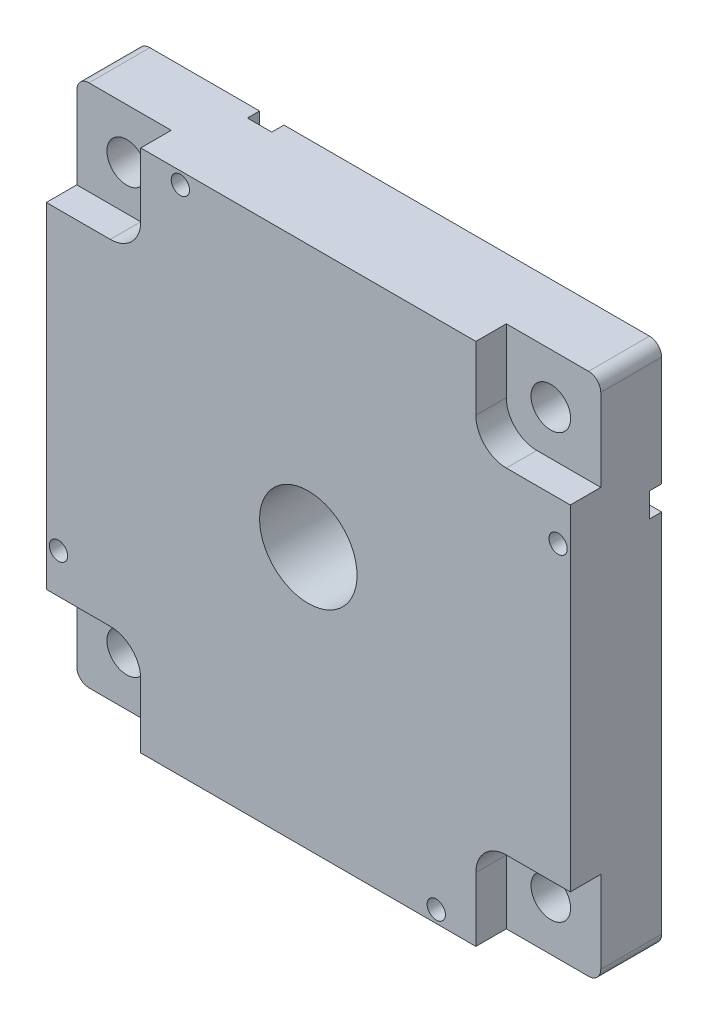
ISO-10303-21;
HEADER;
FILE_DESCRIPTION(('STEP AP214'),'2;1');
FILE_NAME('part.step','',(''),(''),'','','');
FILE_SCHEMA(('AUTOMOTIVE_DESIGN { 1 0 10303 214 1 1 1 1 }'));
ENDSEC;
DATA;
#1=APPLICATION_CONTEXT('core data for automotive mechanical design processes');
#2=APPLICATION_PROTOCOL_DEFINITION('international standard','automotive_design',2000,#1);
#3=PRODUCT_CONTEXT('',#1,'mechanical');
#4=PRODUCT('Part','Part','',(#3));
#5=PRODUCT_RELATED_PRODUCT_CATEGORY('part','',(#4));
#6=PRODUCT_DEFINITION_FORMATION('','',#4);
#7=PRODUCT_DEFINITION_CONTEXT('part definition',#1,'design');
#8=PRODUCT_DEFINITION('design','',#6,#7);
#9=PRODUCT_DEFINITION_SHAPE('','',#8);
#10=(LENGTH_UNIT() NAMED_UNIT(*) SI_UNIT(.MILLI.,.METRE.));
#11=(NAMED_UNIT(*) PLANE_ANGLE_UNIT() SI_UNIT($,.RADIAN.));
#12=(NAMED_UNIT(*) SI_UNIT($,.STERADIAN.) SOLID_ANGLE_UNIT());
#13=UNCERTAINTY_MEASURE_WITH_UNIT(LENGTH_MEASURE(1.E-05),#10,'distance_accuracy_value','');
#14=(GEOMETRIC_REPRESENTATION_CONTEXT(3) GLOBAL_UNCERTAINTY_ASSIGNED_CONTEXT((#13)) GLOBAL_UNIT_ASSIGNED_CONTEXT((#10,
#11,#12)) REPRESENTATION_CONTEXT('',''));
#15=CARTESIAN_POINT('',(0.,0.,0.));
#16=DIRECTION('',(0.,0.,1.));
#17=DIRECTION('',(1.,0.,0.));
#18=AXIS2_PLACEMENT_3D('',#15,#16,#17);
#19=CARTESIAN_POINT('',(32.5,-32.5,15.));
#20=DIRECTION('',(0.,0.,-1.));
#21=DIRECTION('',(-1.,0.,0.));
#22=AXIS2_PLACEMENT_3D('',#19,#20,#21);
#23=CYLINDRICAL_SURFACE('',#22,5.);
#24=DIRECTION('',(0.,0.,1.));
#25=VECTOR('',#24,1.);
#26=CARTESIAN_POINT('',(27.5,-32.5,15.));
#27=LINE('',#26,#25);
#28=CARTESIAN_POINT('',(27.5,-32.5,10.));
#29=VERTEX_POINT('',#28);
#30=CARTESIAN_POINT('',(27.5,-32.5,15.));
#31=VERTEX_POINT('',#30);
#32=EDGE_CURVE('E474',#29,#31,#27,.T.);
#33=ORIENTED_EDGE('',*,*,#32,.F.);
#34=CARTESIAN_POINT('',(32.5,-32.5,10.));
#35=DIRECTION('',(0.,0.,1.));
#36=DIRECTION('',(1.,0.,0.));
#37=AXIS2_PLACEMENT_3D('',#34,#35,#36);
#38=CIRCLE('',#37,5.);
#39=CARTESIAN_POINT('',(32.5,-27.5,10.));
#40=VERTEX_POINT('',#39);
#41=EDGE_CURVE('E41',#40,#29,#38,.T.);
#42=ORIENTED_EDGE('',*,*,#41,.F.);
#43=DIRECTION('',(0.,0.,1.));
#44=VECTOR('',#43,1.);
#45=CARTESIAN_POINT('',(32.5,-27.5,15.));
#46=LINE('',#45,#44);
#47=CARTESIAN_POINT('',(32.5,-27.5,15.));
#48=VERTEX_POINT('',#47);
#49=EDGE_CURVE('E477',#48,#40,#46,.F.);
#50=ORIENTED_EDGE('',*,*,#49,.F.);
#51=CARTESIAN_POINT('',(32.5,-32.5,15.));
#52=DIRECTION('',(0.,0.,1.));
#53=DIRECTION('',(1.,0.,0.));
#54=AXIS2_PLACEMENT_3D('',#51,#52,#53);
#55=CIRCLE('',#54,5.);
#56=EDGE_CURVE('E11',#48,#31,#55,.T.);
#57=ORIENTED_EDGE('',*,*,#56,.T.);
#58=EDGE_LOOP('',(#33,#42,#50,#57));
#59=FACE_BOUND('',#58,.T.);
#60=ADVANCED_FACE('F33',(#59),#23,.F.);
#61=CARTESIAN_POINT('',(-32.5,-32.5,15.));
#62=DIRECTION('',(0.,0.,-1.));
#63=DIRECTION('',(-1.,0.,0.));
#64=AXIS2_PLACEMENT_3D('',#61,#62,#63);
#65=CYLINDRICAL_SURFACE('',#64,5.);
#66=DIRECTION('',(0.,0.,1.));
#67=VECTOR('',#66,1.);
#68=CARTESIAN_POINT('',(-32.5,-27.5,15.));
#69=LINE('',#68,#67);
#70=CARTESIAN_POINT('',(-32.5,-27.5,10.));
#71=VERTEX_POINT('',#70);
#72=CARTESIAN_POINT('',(-32.5,-27.5,15.));
#73=VERTEX_POINT('',#72);
#74=EDGE_CURVE('E461',#71,#73,#69,.T.);
#75=ORIENTED_EDGE('',*,*,#74,.F.);
#76=CARTESIAN_POINT('',(-32.5,-32.5,10.));
#77=DIRECTION('',(0.,0.,1.));
#78=DIRECTION('',(1.,0.,0.));
#79=AXIS2_PLACEMENT_3D('',#76,#77,#78);
#80=CIRCLE('',#79,5.);
#81=CARTESIAN_POINT('',(-27.5,-32.5,10.));
#82=VERTEX_POINT('',#81);
#83=EDGE_CURVE('E470',#82,#71,#80,.T.);
#84=ORIENTED_EDGE('',*,*,#83,.F.);
#85=DIRECTION('',(0.,0.,1.));
#86=VECTOR('',#85,1.);
#87=CARTESIAN_POINT('',(-27.5,-32.5,15.));
#88=LINE('',#87,#86);
#89=CARTESIAN_POINT('',(-27.5,-32.5,15.));
#90=VERTEX_POINT('',#89);
#91=EDGE_CURVE('E464',#90,#82,#88,.F.);
#92=ORIENTED_EDGE('',*,*,#91,.F.);
#93=CARTESIAN_POINT('',(-32.5,-32.5,15.));
#94=DIRECTION('',(0.,0.,1.));
#95=DIRECTION('',(1.,0.,0.));
#96=AXIS2_PLACEMENT_3D('',#93,#94,#95);
#97=CIRCLE('',#96,5.);
#98=EDGE_CURVE('E472',#90,#73,#97,.T.);
#99=ORIENTED_EDGE('',*,*,#98,.T.);
#100=EDGE_LOOP('',(#75,#84,#92,#99));
#101=FACE_BOUND('',#100,.T.);
#102=ADVANCED_FACE('F771',(#101),#65,.F.);
#103=CARTESIAN_POINT('',(-32.5,32.5,15.));
#104=DIRECTION('',(0.,0.,-1.));
#105=DIRECTION('',(-1.,0.,0.));
#106=AXIS2_PLACEMENT_3D('',#103,#104,#105);
#107=CYLINDRICAL_SURFACE('',#106,5.);
#108=DIRECTION('',(0.,0.,1.));
#109=VECTOR('',#108,1.);
#110=CARTESIAN_POINT('',(-27.5,32.5,15.));
#111=LINE('',#110,#109);
#112=CARTESIAN_POINT('',(-27.5,32.5,10.));
#113=VERTEX_POINT('',#112);
#114=CARTESIAN_POINT('',(-27.5,32.5,15.));
#115=VERTEX_POINT('',#114);
#116=EDGE_CURVE('E452',#113,#115,#111,.T.);
#117=ORIENTED_EDGE('',*,*,#116,.F.);
#118=CARTESIAN_POINT('',(-32.5,32.5,10.));
#119=DIRECTION('',(0.,0.,1.));
#120=DIRECTION('',(1.,0.,0.));
#121=AXIS2_PLACEMENT_3D('',#118,#119,#120);
#122=CIRCLE('',#121,5.);
#123=CARTESIAN_POINT('',(-32.5,27.5,10.));
#124=VERTEX_POINT('',#123);
#125=EDGE_CURVE('E457',#124,#113,#122,.T.);
#126=ORIENTED_EDGE('',*,*,#125,.F.);
#127=DIRECTION('',(0.,0.,1.));
#128=VECTOR('',#127,1.);
#129=CARTESIAN_POINT('',(-32.5,27.5,15.));
#130=LINE('',#129,#128);
#131=CARTESIAN_POINT('',(-32.5,27.5,15.));
#132=VERTEX_POINT('',#131);
#133=EDGE_CURVE('E454',#132,#124,#130,.F.);
#134=ORIENTED_EDGE('',*,*,#133,.F.);
#135=CARTESIAN_POINT('',(-32.5,32.5,15.));
#136=DIRECTION('',(0.,0.,1.));
#137=DIRECTION('',(1.,0.,0.));
#138=AXIS2_PLACEMENT_3D('',#135,#136,#137);
#139=CIRCLE('',#138,5.);
#140=EDGE_CURVE('E459',#132,#115,#139,.T.);
#141=ORIENTED_EDGE('',*,*,#140,.T.);
#142=EDGE_LOOP('',(#117,#126,#134,#141));
#143=FACE_BOUND('',#142,.T.);
#144=ADVANCED_FACE('F775',(#143),#107,.F.);
#145=CARTESIAN_POINT('',(32.5,32.5,15.));
#146=DIRECTION('',(0.,0.,1.));
#147=DIRECTION('',(1.,0.,0.));
#148=AXIS2_PLACEMENT_3D('',#145,#146,#147);
#149=CYLINDRICAL_SURFACE('',#148,5.);
#150=DIRECTION('',(0.,0.,-1.));
#151=VECTOR('',#150,1.);
#152=CARTESIAN_POINT('',(27.5,32.5,15.));
#153=LINE('',#152,#151);
#154=CARTESIAN_POINT('',(27.5,32.5,15.));
#155=VERTEX_POINT('',#154);
#156=CARTESIAN_POINT('',(27.5,32.5,10.));
#157=VERTEX_POINT('',#156);
#158=EDGE_CURVE('E493',#155,#157,#153,.T.);
#159=ORIENTED_EDGE('',*,*,#158,.F.);
#160=CARTESIAN_POINT('',(32.5,32.5,15.));
#161=DIRECTION('',(0.,0.,1.));
#162=DIRECTION('',(1.,0.,0.));
#163=AXIS2_PLACEMENT_3D('',#160,#161,#162);
#164=CIRCLE('',#163,5.);
#165=CARTESIAN_POINT('',(32.5,27.5,15.));
#166=VERTEX_POINT('',#165);
#167=EDGE_CURVE('E501',#155,#166,#164,.T.);
#168=ORIENTED_EDGE('',*,*,#167,.T.);
#169=DIRECTION('',(0.,0.,-1.));
#170=VECTOR('',#169,1.);
#171=CARTESIAN_POINT('',(32.5,27.5,15.));
#172=LINE('',#171,#170);
#173=CARTESIAN_POINT('',(32.5,27.5,10.));
#174=VERTEX_POINT('',#173);
#175=EDGE_CURVE('E496',#174,#166,#172,.F.);
#176=ORIENTED_EDGE('',*,*,#175,.F.);
#177=CARTESIAN_POINT('',(32.5,32.5,10.));
#178=DIRECTION('',(0.,0.,1.));
#179=DIRECTION('',(1.,0.,0.));
#180=AXIS2_PLACEMENT_3D('',#177,#178,#179);
#181=CIRCLE('',#180,5.);
#182=EDGE_CURVE('E500',#157,#174,#181,.T.);
#183=ORIENTED_EDGE('',*,*,#182,.F.);
#184=EDGE_LOOP('',(#159,#168,#176,#183));
#185=FACE_BOUND('',#184,.T.);
#186=ADVANCED_FACE('F780',(#185),#149,.F.);
#187=CARTESIAN_POINT('',(0.,0.,10.));
#188=DIRECTION('',(0.,0.,1.));
#189=DIRECTION('',(1.,0.,0.));
#190=AXIS2_PLACEMENT_3D('',#187,#188,#189);
#191=PLANE('',#190);
#192=DIRECTION('',(0.,1.,0.));
#193=VECTOR('',#192,1.);
#194=CARTESIAN_POINT('',(27.5,27.5,10.));
#195=LINE('',#194,#193);
#196=CARTESIAN_POINT('',(27.5,43.,10.));
#197=VERTEX_POINT('',#196);
#198=EDGE_CURVE('E417',#157,#197,#195,.T.);
#199=ORIENTED_EDGE('',*,*,#198,.F.);
#200=ORIENTED_EDGE('',*,*,#182,.T.);
#201=DIRECTION('',(-1.,0.,0.));
#202=VECTOR('',#201,1.);
#203=CARTESIAN_POINT('',(43.,27.5,10.));
#204=LINE('',#203,#202);
#205=CARTESIAN_POINT('',(43.,27.5,10.));
#206=VERTEX_POINT('',#205);
#207=EDGE_CURVE('E480',#206,#174,#204,.T.);
#208=ORIENTED_EDGE('',*,*,#207,.F.);
#209=DIRECTION('',(0.,1.,0.));
#210=VECTOR('',#209,1.);
#211=CARTESIAN_POINT('',(43.,-43.,10.));
#212=LINE('',#211,#210);
#213=CARTESIAN_POINT('',(43.,41.,10.));
#214=VERTEX_POINT('',#213);
#215=EDGE_CURVE('E611',#206,#214,#212,.T.);
#216=ORIENTED_EDGE('',*,*,#215,.T.);
#217=CARTESIAN_POINT('',(41.,41.,10.));
#218=DIRECTION('',(0.,0.,1.));
#219=DIRECTION('',(1.,0.,0.));
#220=AXIS2_PLACEMENT_3D('',#217,#218,#219);
#221=CIRCLE('',#220,2.);
#222=CARTESIAN_POINT('',(41.,43.,10.));
#223=VERTEX_POINT('',#222);
#224=EDGE_CURVE('E646',#214,#223,#221,.T.);
#225=ORIENTED_EDGE('',*,*,#224,.T.);
#226=DIRECTION('',(-1.,0.,0.));
#227=VECTOR('',#226,1.);
#228=CARTESIAN_POINT('',(43.,43.,10.));
#229=LINE('',#228,#227);
#230=EDGE_CURVE('E654',#223,#197,#229,.T.);
#231=ORIENTED_EDGE('',*,*,#230,.T.);
#232=EDGE_LOOP('',(#199,#200,#208,#216,#225,#231));
#233=FACE_BOUND('',#232,.T.);
#234=CARTESIAN_POINT('',(34.8,34.8,10.));
#235=DIRECTION('',(0.,0.,-1.));
#236=DIRECTION('',(-1.,0.,0.));
#237=AXIS2_PLACEMENT_3D('',#234,#235,#236);
#238=CIRCLE('',#237,3.25);
#239=CARTESIAN_POINT('',(31.55,34.8,10.));
#240=VERTEX_POINT('',#239);
#241=EDGE_CURVE('E936',#240,#240,#238,.T.);
#242=ORIENTED_EDGE('',*,*,#241,.T.);
#243=EDGE_LOOP('',(#242));
#244=FACE_BOUND('',#243,.T.);
#245=ADVANCED_FACE('F786',(#233,#244),#191,.T.);
#246=DIRECTION('',(1.,0.,0.));
#247=VECTOR('',#246,1.);
#248=CARTESIAN_POINT('',(43.,-27.5,10.));
#249=LINE('',#248,#247);
#250=CARTESIAN_POINT('',(43.,-27.5,10.));
#251=VERTEX_POINT('',#250);
#252=EDGE_CURVE('E478',#40,#251,#249,.T.);
#253=ORIENTED_EDGE('',*,*,#252,.F.);
#254=ORIENTED_EDGE('',*,*,#41,.T.);
#255=DIRECTION('',(0.,1.,0.));
#256=VECTOR('',#255,1.);
#257=CARTESIAN_POINT('',(27.5,-43.,10.));
#258=LINE('',#257,#256);
#259=CARTESIAN_POINT('',(27.5,-43.,10.));
#260=VERTEX_POINT('',#259);
#261=EDGE_CURVE('E467',#260,#29,#258,.T.);
#262=ORIENTED_EDGE('',*,*,#261,.F.);
#263=DIRECTION('',(1.,0.,0.));
#264=VECTOR('',#263,1.);
#265=CARTESIAN_POINT('',(43.,-43.,10.));
#266=LINE('',#265,#264);
#267=CARTESIAN_POINT('',(41.,-43.,10.));
#268=VERTEX_POINT('',#267);
#269=EDGE_CURVE('E605',#260,#268,#266,.T.);
#270=ORIENTED_EDGE('',*,*,#269,.T.);
#271=CARTESIAN_POINT('',(41.,-41.,10.));
#272=DIRECTION('',(0.,0.,1.));
#273=DIRECTION('',(1.,0.,0.));
#274=AXIS2_PLACEMENT_3D('',#271,#272,#273);
#275=CIRCLE('',#274,2.);
#276=CARTESIAN_POINT('',(43.,-41.,10.));
#277=VERTEX_POINT('',#276);
#278=EDGE_CURVE('E497',#268,#277,#275,.T.);
#279=ORIENTED_EDGE('',*,*,#278,.T.);
#280=EDGE_CURVE('E673',#277,#251,#212,.T.);
#281=ORIENTED_EDGE('',*,*,#280,.T.);
#282=EDGE_LOOP('',(#253,#254,#262,#270,#279,#281));
#283=FACE_BOUND('',#282,.T.);
#284=CARTESIAN_POINT('',(34.7999999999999,-34.8000000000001,10.));
#285=DIRECTION('',(0.,0.,-1.));
#286=DIRECTION('',(0.,1.,0.));
#287=AXIS2_PLACEMENT_3D('',#284,#285,#286);
#288=CIRCLE('',#287,3.25);
#289=CARTESIAN_POINT('',(34.7999999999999,-31.5500000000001,10.));
#290=VERTEX_POINT('',#289);
#291=EDGE_CURVE('E966',#290,#290,#288,.T.);
#292=ORIENTED_EDGE('',*,*,#291,.T.);
#293=EDGE_LOOP('',(#292));
#294=FACE_BOUND('',#293,.T.);
#295=ADVANCED_FACE('F699',(#283,#294),#191,.T.);
#296=DIRECTION('',(0.,-1.,0.));
#297=VECTOR('',#296,1.);
#298=CARTESIAN_POINT('',(-27.5,-43.,10.));
#299=LINE('',#298,#297);
#300=CARTESIAN_POINT('',(-27.5,-43.,10.));
#301=VERTEX_POINT('',#300);
#302=EDGE_CURVE('E465',#82,#301,#299,.T.);
#303=ORIENTED_EDGE('',*,*,#302,.F.);
#304=ORIENTED_EDGE('',*,*,#83,.T.);
#305=DIRECTION('',(1.,0.,0.));
#306=VECTOR('',#305,1.);
#307=CARTESIAN_POINT('',(-27.5,-27.5,10.));
#308=LINE('',#307,#306);
#309=CARTESIAN_POINT('',(-43.,-27.5,10.));
#310=VERTEX_POINT('',#309);
#311=EDGE_CURVE('E451',#310,#71,#308,.T.);
#312=ORIENTED_EDGE('',*,*,#311,.F.);
#313=DIRECTION('',(0.,-1.,0.));
#314=VECTOR('',#313,1.);
#315=CARTESIAN_POINT('',(-43.,-43.,10.));
#316=LINE('',#315,#314);
#317=CARTESIAN_POINT('',(-43.,-41.,10.));
#318=VERTEX_POINT('',#317);
#319=EDGE_CURVE('E586',#310,#318,#316,.T.);
#320=ORIENTED_EDGE('',*,*,#319,.T.);
#321=CARTESIAN_POINT('',(-41.,-41.,10.));
#322=DIRECTION('',(0.,0.,1.));
#323=DIRECTION('',(1.,0.,0.));
#324=AXIS2_PLACEMENT_3D('',#321,#322,#323);
#325=CIRCLE('',#324,2.);
#326=CARTESIAN_POINT('',(-41.,-43.,10.));
#327=VERTEX_POINT('',#326);
#328=EDGE_CURVE('E622',#318,#327,#325,.T.);
#329=ORIENTED_EDGE('',*,*,#328,.T.);
#330=EDGE_CURVE('E608',#327,#301,#266,.T.);
#331=ORIENTED_EDGE('',*,*,#330,.T.);
#332=EDGE_LOOP('',(#303,#304,#312,#320,#329,#331));
#333=FACE_BOUND('',#332,.T.);
#334=CARTESIAN_POINT('',(-34.8,-34.8,10.));
#335=DIRECTION('',(0.,0.,-1.));
#336=DIRECTION('',(1.,0.,0.));
#337=AXIS2_PLACEMENT_3D('',#334,#335,#336);
#338=CIRCLE('',#337,3.25);
#339=CARTESIAN_POINT('',(-31.55,-34.8,10.));
#340=VERTEX_POINT('',#339);
#341=EDGE_CURVE('E970',#340,#340,#338,.T.);
#342=ORIENTED_EDGE('',*,*,#341,.T.);
#343=EDGE_LOOP('',(#342));
#344=FACE_BOUND('',#343,.T.);
#345=ADVANCED_FACE('F738',(#333,#344),#191,.T.);
#346=CARTESIAN_POINT('',(41.,-41.,10.));
#347=DIRECTION('',(0.,0.,1.));
#348=DIRECTION('',(1.,0.,0.));
#349=AXIS2_PLACEMENT_3D('',#346,#347,#348);
#350=CYLINDRICAL_SURFACE('',#349,2.);
#351=DIRECTION('',(0.,0.,1.));
#352=VECTOR('',#351,1.);
#353=CARTESIAN_POINT('',(41.,-43.,10.));
#354=LINE('',#353,#352);
#355=CARTESIAN_POINT('',(41.,-43.,0.));
#356=VERTEX_POINT('',#355);
#357=EDGE_CURVE('E619',#356,#268,#354,.T.);
#358=ORIENTED_EDGE('',*,*,#357,.F.);
#359=CARTESIAN_POINT('',(41.,-41.,0.));
#360=DIRECTION('',(0.,0.,1.));
#361=DIRECTION('',(1.,0.,0.));
#362=AXIS2_PLACEMENT_3D('',#359,#360,#361);
#363=CIRCLE('',#362,2.);
#364=CARTESIAN_POINT('',(43.,-41.,0.));
#365=VERTEX_POINT('',#364);
#366=EDGE_CURVE('E613',#365,#356,#363,.F.);
#367=ORIENTED_EDGE('',*,*,#366,.F.);
#368=DIRECTION('',(0.,0.,1.));
#369=VECTOR('',#368,1.);
#370=CARTESIAN_POINT('',(43.,-41.,10.));
#371=LINE('',#370,#369);
#372=EDGE_CURVE('E616',#277,#365,#371,.F.);
#373=ORIENTED_EDGE('',*,*,#372,.F.);
#374=ORIENTED_EDGE('',*,*,#278,.F.);
#375=EDGE_LOOP('',(#358,#367,#373,#374));
#376=FACE_BOUND('',#375,.T.);
#377=ADVANCED_FACE('F706',(#376),#350,.T.);
#378=CARTESIAN_POINT('',(-41.,-41.,10.));
#379=DIRECTION('',(0.,0.,1.));
#380=DIRECTION('',(1.,0.,0.));
#381=AXIS2_PLACEMENT_3D('',#378,#379,#380);
#382=CYLINDRICAL_SURFACE('',#381,2.);
#383=DIRECTION('',(0.,0.,1.));
#384=VECTOR('',#383,1.);
#385=CARTESIAN_POINT('',(-43.,-41.,10.));
#386=LINE('',#385,#384);
#387=CARTESIAN_POINT('',(-43.,-41.,0.));
#388=VERTEX_POINT('',#387);
#389=EDGE_CURVE('E630',#388,#318,#386,.T.);
#390=ORIENTED_EDGE('',*,*,#389,.F.);
#391=CARTESIAN_POINT('',(-41.,-41.,0.));
#392=DIRECTION('',(0.,0.,1.));
#393=DIRECTION('',(1.,0.,0.));
#394=AXIS2_PLACEMENT_3D('',#391,#392,#393);
#395=CIRCLE('',#394,2.);
#396=CARTESIAN_POINT('',(-41.,-43.,0.));
#397=VERTEX_POINT('',#396);
#398=EDGE_CURVE('E624',#397,#388,#395,.F.);
#399=ORIENTED_EDGE('',*,*,#398,.F.);
#400=DIRECTION('',(0.,0.,1.));
#401=VECTOR('',#400,1.);
#402=CARTESIAN_POINT('',(-41.,-43.,10.));
#403=LINE('',#402,#401);
#404=EDGE_CURVE('E627',#327,#397,#403,.F.);
#405=ORIENTED_EDGE('',*,*,#404,.F.);
#406=ORIENTED_EDGE('',*,*,#328,.F.);
#407=EDGE_LOOP('',(#390,#399,#405,#406));
#408=FACE_BOUND('',#407,.T.);
#409=ADVANCED_FACE('F789',(#408),#382,.T.);
#410=CARTESIAN_POINT('',(-41.,41.,10.));
#411=DIRECTION('',(0.,0.,1.));
#412=DIRECTION('',(1.,0.,0.));
#413=AXIS2_PLACEMENT_3D('',#410,#411,#412);
#414=CYLINDRICAL_SURFACE('',#413,2.);
#415=DIRECTION('',(0.,0.,1.));
#416=VECTOR('',#415,1.);
#417=CARTESIAN_POINT('',(-41.,43.,10.));
#418=LINE('',#417,#416);
#419=CARTESIAN_POINT('',(-41.,43.,0.));
#420=VERTEX_POINT('',#419);
#421=CARTESIAN_POINT('',(-41.,43.,10.));
#422=VERTEX_POINT('',#421);
#423=EDGE_CURVE('E641',#420,#422,#418,.T.);
#424=ORIENTED_EDGE('',*,*,#423,.F.);
#425=CARTESIAN_POINT('',(-41.,41.,0.));
#426=DIRECTION('',(0.,0.,1.));
#427=DIRECTION('',(1.,0.,0.));
#428=AXIS2_PLACEMENT_3D('',#425,#426,#427);
#429=CIRCLE('',#428,2.);
#430=CARTESIAN_POINT('',(-43.,41.,0.));
#431=VERTEX_POINT('',#430);
#432=EDGE_CURVE('E635',#431,#420,#429,.F.);
#433=ORIENTED_EDGE('',*,*,#432,.F.);
#434=DIRECTION('',(0.,0.,1.));
#435=VECTOR('',#434,1.);
#436=CARTESIAN_POINT('',(-43.,41.,10.));
#437=LINE('',#436,#435);
#438=CARTESIAN_POINT('',(-43.,41.,10.));
#439=VERTEX_POINT('',#438);
#440=EDGE_CURVE('E638',#439,#431,#437,.F.);
#441=ORIENTED_EDGE('',*,*,#440,.F.);
#442=CARTESIAN_POINT('',(-41.,41.,10.));
#443=DIRECTION('',(0.,0.,1.));
#444=DIRECTION('',(1.,0.,0.));
#445=AXIS2_PLACEMENT_3D('',#442,#443,#444);
#446=CIRCLE('',#445,2.);
#447=EDGE_CURVE('E633',#422,#439,#446,.T.);
#448=ORIENTED_EDGE('',*,*,#447,.F.);
#449=EDGE_LOOP('',(#424,#433,#441,#448));
#450=FACE_BOUND('',#449,.T.);
#451=ADVANCED_FACE('F687',(#450),#414,.T.);
#452=CARTESIAN_POINT('',(41.,41.,10.));
#453=DIRECTION('',(0.,0.,-1.));
#454=DIRECTION('',(-1.,0.,0.));
#455=AXIS2_PLACEMENT_3D('',#452,#453,#454);
#456=CYLINDRICAL_SURFACE('',#455,2.);
#457=DIRECTION('',(0.,0.,-1.));
#458=VECTOR('',#457,1.);
#459=CARTESIAN_POINT('',(41.,43.,10.));
#460=LINE('',#459,#458);
#461=CARTESIAN_POINT('',(41.,43.,0.));
#462=VERTEX_POINT('',#461);
#463=EDGE_CURVE('E651',#223,#462,#460,.T.);
#464=ORIENTED_EDGE('',*,*,#463,.F.);
#465=ORIENTED_EDGE('',*,*,#224,.F.);
#466=DIRECTION('',(0.,0.,-1.));
#467=VECTOR('',#466,1.);
#468=CARTESIAN_POINT('',(43.,41.,10.));
#469=LINE('',#468,#467);
#470=CARTESIAN_POINT('',(43.,41.,0.));
#471=VERTEX_POINT('',#470);
#472=EDGE_CURVE('E648',#471,#214,#469,.F.);
#473=ORIENTED_EDGE('',*,*,#472,.F.);
#474=CARTESIAN_POINT('',(41.,41.,0.));
#475=DIRECTION('',(0.,0.,1.));
#476=DIRECTION('',(1.,0.,0.));
#477=AXIS2_PLACEMENT_3D('',#474,#475,#476);
#478=CIRCLE('',#477,2.);
#479=EDGE_CURVE('E643',#462,#471,#478,.F.);
#480=ORIENTED_EDGE('',*,*,#479,.F.);
#481=EDGE_LOOP('',(#464,#465,#473,#480));
#482=FACE_BOUND('',#481,.T.);
#483=ADVANCED_FACE('F794',(#482),#456,.T.);
#484=CARTESIAN_POINT('',(-43.,-43.,10.));
#485=DIRECTION('',(1.,0.,0.));
#486=DIRECTION('',(0.,0.,-1.));
#487=AXIS2_PLACEMENT_3D('',#484,#485,#486);
#488=PLANE('',#487);
#489=DIRECTION('',(0.,-1.,0.));
#490=VECTOR('',#489,1.);
#491=CARTESIAN_POINT('',(-43.,-43.,0.));
#492=LINE('',#491,#490);
#493=CARTESIAN_POINT('',(-43.0000000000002,-18.9999999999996,0.));
#494=VERTEX_POINT('',#493);
#495=EDGE_CURVE('E665',#431,#494,#492,.T.);
#496=ORIENTED_EDGE('',*,*,#495,.T.);
#497=DIRECTION('',(0.,0.,-1.));
#498=VECTOR('',#497,1.);
#499=CARTESIAN_POINT('',(-43.0000000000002,-18.9999999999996,2.));
#500=LINE('',#499,#498);
#501=CARTESIAN_POINT('',(-43.0000000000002,-18.9999999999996,2.));
#502=VERTEX_POINT('',#501);
#503=EDGE_CURVE('E324',#502,#494,#500,.T.);
#504=ORIENTED_EDGE('',*,*,#503,.F.);
#505=DIRECTION('',(0.,1.,0.));
#506=VECTOR('',#505,1.);
#507=CARTESIAN_POINT('',(-43.0000000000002,-18.9999999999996,2.));
#508=LINE('',#507,#506);
#509=CARTESIAN_POINT('',(-43.0000000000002,-22.9999999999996,2.));
#510=VERTEX_POINT('',#509);
#511=EDGE_CURVE('E305',#510,#502,#508,.T.);
#512=ORIENTED_EDGE('',*,*,#511,.F.);
#513=DIRECTION('',(0.,0.,-1.));
#514=VECTOR('',#513,1.);
#515=CARTESIAN_POINT('',(-43.0000000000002,-22.9999999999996,2.));
#516=LINE('',#515,#514);
#517=CARTESIAN_POINT('',(-43.0000000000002,-22.9999999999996,0.));
#518=VERTEX_POINT('',#517);
#519=EDGE_CURVE('E296',#510,#518,#516,.T.);
#520=ORIENTED_EDGE('',*,*,#519,.T.);
#521=EDGE_CURVE('E667',#518,#388,#492,.T.);
#522=ORIENTED_EDGE('',*,*,#521,.T.);
#523=ORIENTED_EDGE('',*,*,#389,.T.);
#524=ORIENTED_EDGE('',*,*,#319,.F.);
#525=DIRECTION('',(0.,0.,-1.));
#526=VECTOR('',#525,1.);
#527=CARTESIAN_POINT('',(-43.,-27.5,15.));
#528=LINE('',#527,#526);
#529=CARTESIAN_POINT('',(-43.,-27.5,15.));
#530=VERTEX_POINT('',#529);
#531=EDGE_CURVE('E565',#530,#310,#528,.T.);
#532=ORIENTED_EDGE('',*,*,#531,.F.);
#533=DIRECTION('',(0.,-1.,0.));
#534=VECTOR('',#533,1.);
#535=CARTESIAN_POINT('',(-43.,-27.5,15.));
#536=LINE('',#535,#534);
#537=CARTESIAN_POINT('',(-43.,27.5,15.));
#538=VERTEX_POINT('',#537);
#539=EDGE_CURVE('E419',#538,#530,#536,.T.);
#540=ORIENTED_EDGE('',*,*,#539,.F.);
#541=DIRECTION('',(0.,0.,-1.));
#542=VECTOR('',#541,1.);
#543=CARTESIAN_POINT('',(-43.,27.5,15.));
#544=LINE('',#543,#542);
#545=CARTESIAN_POINT('',(-43.,27.5,10.));
#546=VERTEX_POINT('',#545);
#547=EDGE_CURVE('E572',#538,#546,#544,.T.);
#548=ORIENTED_EDGE('',*,*,#547,.T.);
#549=EDGE_CURVE('E590',#439,#546,#316,.T.);
#550=ORIENTED_EDGE('',*,*,#549,.F.);
#551=ORIENTED_EDGE('',*,*,#440,.T.);
#552=EDGE_LOOP('',(#496,#504,#512,#520,#522,#523,#524,#532,#540,#548,#550,#551));
#553=FACE_BOUND('',#552,.T.);
#554=ADVANCED_FACE('F695',(#553),#488,.F.);
#555=CARTESIAN_POINT('',(43.,-43.,10.));
#556=DIRECTION('',(0.,1.,0.));
#557=DIRECTION('',(-1.,0.,0.));
#558=AXIS2_PLACEMENT_3D('',#555,#556,#557);
#559=PLANE('',#558);
#560=DIRECTION('',(1.,0.,0.));
#561=VECTOR('',#560,1.);
#562=CARTESIAN_POINT('',(43.,-43.,0.));
#563=LINE('',#562,#561);
#564=CARTESIAN_POINT('',(19.,-43.,0.));
#565=VERTEX_POINT('',#564);
#566=EDGE_CURVE('E661',#397,#565,#563,.T.);
#567=ORIENTED_EDGE('',*,*,#566,.T.);
#568=DIRECTION('',(0.,0.,-1.));
#569=VECTOR('',#568,1.);
#570=CARTESIAN_POINT('',(19.,-43.,2.));
#571=LINE('',#570,#569);
#572=CARTESIAN_POINT('',(19.,-43.,2.));
#573=VERTEX_POINT('',#572);
#574=EDGE_CURVE('E348',#573,#565,#571,.T.);
#575=ORIENTED_EDGE('',*,*,#574,.F.);
#576=DIRECTION('',(-1.,0.,0.));
#577=VECTOR('',#576,1.);
#578=CARTESIAN_POINT('',(19.,-43.,2.));
#579=LINE('',#578,#577);
#580=CARTESIAN_POINT('',(23.,-43.,2.));
#581=VERTEX_POINT('',#580);
#582=EDGE_CURVE('E334',#581,#573,#579,.T.);
#583=ORIENTED_EDGE('',*,*,#582,.F.);
#584=DIRECTION('',(0.,0.,-1.));
#585=VECTOR('',#584,1.);
#586=CARTESIAN_POINT('',(23.,-43.,2.));
#587=LINE('',#586,#585);
#588=CARTESIAN_POINT('',(23.,-43.,0.));
#589=VERTEX_POINT('',#588);
#590=EDGE_CURVE('E350',#581,#589,#587,.T.);
#591=ORIENTED_EDGE('',*,*,#590,.T.);
#592=EDGE_CURVE('E664',#589,#356,#563,.T.);
#593=ORIENTED_EDGE('',*,*,#592,.T.);
#594=ORIENTED_EDGE('',*,*,#357,.T.);
#595=ORIENTED_EDGE('',*,*,#269,.F.);
#596=DIRECTION('',(0.,0.,-1.));
#597=VECTOR('',#596,1.);
#598=CARTESIAN_POINT('',(27.5,-43.,15.));
#599=LINE('',#598,#597);
#600=CARTESIAN_POINT('',(27.5,-43.,15.));
#601=VERTEX_POINT('',#600);
#602=EDGE_CURVE('E551',#601,#260,#599,.T.);
#603=ORIENTED_EDGE('',*,*,#602,.F.);
#604=DIRECTION('',(1.,0.,0.));
#605=VECTOR('',#604,1.);
#606=CARTESIAN_POINT('',(27.5,-43.,15.));
#607=LINE('',#606,#605);
#608=CARTESIAN_POINT('',(-27.5,-43.,15.));
#609=VERTEX_POINT('',#608);
#610=EDGE_CURVE('E426',#609,#601,#607,.T.);
#611=ORIENTED_EDGE('',*,*,#610,.F.);
#612=DIRECTION('',(0.,0.,-1.));
#613=VECTOR('',#612,1.);
#614=CARTESIAN_POINT('',(-27.5,-43.,15.));
#615=LINE('',#614,#613);
#616=EDGE_CURVE('E560',#609,#301,#615,.T.);
#617=ORIENTED_EDGE('',*,*,#616,.T.);
#618=ORIENTED_EDGE('',*,*,#330,.F.);
#619=ORIENTED_EDGE('',*,*,#404,.T.);
#620=EDGE_LOOP('',(#567,#575,#583,#591,#593,#594,#595,#603,#611,#617,#618,#619));
#621=FACE_BOUND('',#620,.T.);
#622=ADVANCED_FACE('F707',(#621),#559,.F.);
#623=CARTESIAN_POINT('',(43.,-43.,10.));
#624=DIRECTION('',(-1.,0.,0.));
#625=DIRECTION('',(0.,0.,1.));
#626=AXIS2_PLACEMENT_3D('',#623,#624,#625);
#627=PLANE('',#626);
#628=DIRECTION('',(0.,1.,0.));
#629=VECTOR('',#628,1.);
#630=CARTESIAN_POINT('',(43.,-43.,0.));
#631=LINE('',#630,#629);
#632=CARTESIAN_POINT('',(43.0000000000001,18.9999999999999,0.));
#633=VERTEX_POINT('',#632);
#634=EDGE_CURVE('E657',#365,#633,#631,.T.);
#635=ORIENTED_EDGE('',*,*,#634,.T.);
#636=DIRECTION('',(0.,0.,-1.));
#637=VECTOR('',#636,1.);
#638=CARTESIAN_POINT('',(43.0000000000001,18.9999999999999,2.));
#639=LINE('',#638,#637);
#640=CARTESIAN_POINT('',(43.0000000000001,18.9999999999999,2.));
#641=VERTEX_POINT('',#640);
#642=EDGE_CURVE('E375',#641,#633,#639,.T.);
#643=ORIENTED_EDGE('',*,*,#642,.F.);
#644=DIRECTION('',(0.,-1.,0.));
#645=VECTOR('',#644,1.);
#646=CARTESIAN_POINT('',(43.0000000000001,18.9999999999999,2.));
#647=LINE('',#646,#645);
#648=CARTESIAN_POINT('',(43.0000000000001,22.9999999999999,2.));
#649=VERTEX_POINT('',#648);
#650=EDGE_CURVE('E361',#649,#641,#647,.T.);
#651=ORIENTED_EDGE('',*,*,#650,.F.);
#652=DIRECTION('',(0.,0.,-1.));
#653=VECTOR('',#652,1.);
#654=CARTESIAN_POINT('',(43.0000000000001,22.9999999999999,2.));
#655=LINE('',#654,#653);
#656=CARTESIAN_POINT('',(43.0000000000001,22.9999999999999,0.));
#657=VERTEX_POINT('',#656);
#658=EDGE_CURVE('E377',#649,#657,#655,.T.);
#659=ORIENTED_EDGE('',*,*,#658,.T.);
#660=EDGE_CURVE('E660',#657,#471,#631,.T.);
#661=ORIENTED_EDGE('',*,*,#660,.T.);
#662=ORIENTED_EDGE('',*,*,#472,.T.);
#663=ORIENTED_EDGE('',*,*,#215,.F.);
#664=DIRECTION('',(0.,0.,-1.));
#665=VECTOR('',#664,1.);
#666=CARTESIAN_POINT('',(43.,27.5,15.));
#667=LINE('',#666,#665);
#668=CARTESIAN_POINT('',(43.,27.5,15.));
#669=VERTEX_POINT('',#668);
#670=EDGE_CURVE('E530',#669,#206,#667,.T.);
#671=ORIENTED_EDGE('',*,*,#670,.F.);
#672=DIRECTION('',(0.,1.,0.));
#673=VECTOR('',#672,1.);
#674=CARTESIAN_POINT('',(43.,-27.5,15.));
#675=LINE('',#674,#673);
#676=CARTESIAN_POINT('',(43.,-27.5,15.));
#677=VERTEX_POINT('',#676);
#678=EDGE_CURVE('E433',#677,#669,#675,.T.);
#679=ORIENTED_EDGE('',*,*,#678,.F.);
#680=DIRECTION('',(0.,0.,-1.));
#681=VECTOR('',#680,1.);
#682=CARTESIAN_POINT('',(43.,-27.5,15.));
#683=LINE('',#682,#681);
#684=EDGE_CURVE('E546',#677,#251,#683,.T.);
#685=ORIENTED_EDGE('',*,*,#684,.T.);
#686=ORIENTED_EDGE('',*,*,#280,.F.);
#687=ORIENTED_EDGE('',*,*,#372,.T.);
#688=EDGE_LOOP('',(#635,#643,#651,#659,#661,#662,#663,#671,#679,#685,#686,#687));
#689=FACE_BOUND('',#688,.T.);
#690=ADVANCED_FACE('F714',(#689),#627,.F.);
#691=CARTESIAN_POINT('',(43.,43.,10.));
#692=DIRECTION('',(0.,-1.,0.));
#693=DIRECTION('',(1.,0.,0.));
#694=AXIS2_PLACEMENT_3D('',#691,#692,#693);
#695=PLANE('',#694);
#696=DIRECTION('',(-1.,0.,0.));
#697=VECTOR('',#696,1.);
#698=CARTESIAN_POINT('',(43.,43.,0.));
#699=LINE('',#698,#697);
#700=CARTESIAN_POINT('',(-19.,43.,0.));
#701=VERTEX_POINT('',#700);
#702=EDGE_CURVE('E591',#462,#701,#699,.T.);
#703=ORIENTED_EDGE('',*,*,#702,.T.);
#704=DIRECTION('',(0.,0.,-1.));
#705=VECTOR('',#704,1.);
#706=CARTESIAN_POINT('',(-19.,43.,2.));
#707=LINE('',#706,#705);
#708=CARTESIAN_POINT('',(-19.,43.,2.));
#709=VERTEX_POINT('',#708);
#710=EDGE_CURVE('E403',#709,#701,#707,.T.);
#711=ORIENTED_EDGE('',*,*,#710,.F.);
#712=DIRECTION('',(1.,0.,0.));
#713=VECTOR('',#712,1.);
#714=CARTESIAN_POINT('',(-19.,43.,2.));
#715=LINE('',#714,#713);
#716=CARTESIAN_POINT('',(-23.,43.,2.));
#717=VERTEX_POINT('',#716);
#718=EDGE_CURVE('E389',#717,#709,#715,.T.);
#719=ORIENTED_EDGE('',*,*,#718,.F.);
#720=DIRECTION('',(0.,0.,-1.));
#721=VECTOR('',#720,1.);
#722=CARTESIAN_POINT('',(-23.,43.,2.));
#723=LINE('',#722,#721);
#724=CARTESIAN_POINT('',(-23.,43.,0.));
#725=VERTEX_POINT('',#724);
#726=EDGE_CURVE('E405',#717,#725,#723,.T.);
#727=ORIENTED_EDGE('',*,*,#726,.T.);
#728=EDGE_CURVE('E656',#725,#420,#699,.T.);
#729=ORIENTED_EDGE('',*,*,#728,.T.);
#730=ORIENTED_EDGE('',*,*,#423,.T.);
#731=CARTESIAN_POINT('',(-27.5,43.,10.));
#732=VERTEX_POINT('',#731);
#733=EDGE_CURVE('E527',#732,#422,#229,.T.);
#734=ORIENTED_EDGE('',*,*,#733,.F.);
#735=DIRECTION('',(0.,0.,-1.));
#736=VECTOR('',#735,1.);
#737=CARTESIAN_POINT('',(-27.5,43.,15.));
#738=LINE('',#737,#736);
#739=CARTESIAN_POINT('',(-27.5,43.,15.));
#740=VERTEX_POINT('',#739);
#741=EDGE_CURVE('E442',#740,#732,#738,.T.);
#742=ORIENTED_EDGE('',*,*,#741,.F.);
#743=DIRECTION('',(-1.,0.,0.));
#744=VECTOR('',#743,1.);
#745=CARTESIAN_POINT('',(27.5,43.,15.));
#746=LINE('',#745,#744);
#747=CARTESIAN_POINT('',(27.5,43.,15.));
#748=VERTEX_POINT('',#747);
#749=EDGE_CURVE('E440',#748,#740,#746,.T.);
#750=ORIENTED_EDGE('',*,*,#749,.F.);
#751=DIRECTION('',(0.,0.,-1.));
#752=VECTOR('',#751,1.);
#753=CARTESIAN_POINT('',(27.5,43.,15.));
#754=LINE('',#753,#752);
#755=EDGE_CURVE('E528',#748,#197,#754,.T.);
#756=ORIENTED_EDGE('',*,*,#755,.T.);
#757=ORIENTED_EDGE('',*,*,#230,.F.);
#758=ORIENTED_EDGE('',*,*,#463,.T.);
#759=EDGE_LOOP('',(#703,#711,#719,#727,#729,#730,#734,#742,#750,#756,#757,#758));
#760=FACE_BOUND('',#759,.T.);
#761=ADVANCED_FACE('F525',(#760),#695,.F.);
#762=DIRECTION('',(-1.,0.,0.));
#763=VECTOR('',#762,1.);
#764=CARTESIAN_POINT('',(-27.5,27.5,10.));
#765=LINE('',#764,#763);
#766=EDGE_CURVE('E448',#124,#546,#765,.T.);
#767=ORIENTED_EDGE('',*,*,#766,.F.);
#768=ORIENTED_EDGE('',*,*,#125,.T.);
#769=DIRECTION('',(0.,-1.,0.));
#770=VECTOR('',#769,1.);
#771=CARTESIAN_POINT('',(-27.5,27.5,10.));
#772=LINE('',#771,#770);
#773=EDGE_CURVE('E412',#732,#113,#772,.T.);
#774=ORIENTED_EDGE('',*,*,#773,.F.);
#775=ORIENTED_EDGE('',*,*,#733,.T.);
#776=ORIENTED_EDGE('',*,*,#447,.T.);
#777=ORIENTED_EDGE('',*,*,#549,.T.);
#778=EDGE_LOOP('',(#767,#768,#774,#775,#776,#777));
#779=FACE_BOUND('',#778,.T.);
#780=CARTESIAN_POINT('',(-34.7999999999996,34.8000000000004,10.));
#781=DIRECTION('',(0.,0.,-1.));
#782=DIRECTION('',(0.,-1.,0.));
#783=AXIS2_PLACEMENT_3D('',#780,#781,#782);
#784=CIRCLE('',#783,3.25);
#785=CARTESIAN_POINT('',(-34.7999999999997,31.5500000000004,10.));
#786=VERTEX_POINT('',#785);
#787=EDGE_CURVE('E486',#786,#786,#784,.T.);
#788=ORIENTED_EDGE('',*,*,#787,.T.);
#789=EDGE_LOOP('',(#788));
#790=FACE_BOUND('',#789,.T.);
#791=ADVANCED_FACE('F681',(#779,#790),#191,.T.);
#792=CARTESIAN_POINT('',(0.,0.,0.));
#793=DIRECTION('',(0.,0.,1.));
#794=DIRECTION('',(1.,0.,0.));
#795=AXIS2_PLACEMENT_3D('',#792,#793,#794);
#796=PLANE('',#795);
#797=CARTESIAN_POINT('',(-34.7999999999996,34.8000000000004,0.));
#798=DIRECTION('',(0.,0.,-1.));
#799=DIRECTION('',(0.,-1.,0.));
#800=AXIS2_PLACEMENT_3D('',#797,#798,#799);
#801=CIRCLE('',#800,3.25);
#802=CARTESIAN_POINT('',(-34.7999999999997,31.5500000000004,0.));
#803=VERTEX_POINT('',#802);
#804=EDGE_CURVE('E577',#803,#803,#801,.T.);
#805=ORIENTED_EDGE('',*,*,#804,.F.);
#806=EDGE_LOOP('',(#805));
#807=FACE_BOUND('',#806,.T.);
#808=CARTESIAN_POINT('',(-34.8,-34.8,0.));
#809=DIRECTION('',(0.,0.,-1.));
#810=DIRECTION('',(1.,0.,0.));
#811=AXIS2_PLACEMENT_3D('',#808,#809,#810);
#812=CIRCLE('',#811,3.25);
#813=CARTESIAN_POINT('',(-31.55,-34.8,0.));
#814=VERTEX_POINT('',#813);
#815=EDGE_CURVE('E973',#814,#814,#812,.T.);
#816=ORIENTED_EDGE('',*,*,#815,.F.);
#817=EDGE_LOOP('',(#816));
#818=FACE_BOUND('',#817,.T.);
#819=CARTESIAN_POINT('',(34.7999999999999,-34.8000000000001,0.));
#820=DIRECTION('',(0.,0.,-1.));
#821=DIRECTION('',(0.,1.,0.));
#822=AXIS2_PLACEMENT_3D('',#819,#820,#821);
#823=CIRCLE('',#822,3.25);
#824=CARTESIAN_POINT('',(34.7999999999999,-31.5500000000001,0.));
#825=VERTEX_POINT('',#824);
#826=EDGE_CURVE('E967',#825,#825,#823,.T.);
#827=ORIENTED_EDGE('',*,*,#826,.F.);
#828=EDGE_LOOP('',(#827));
#829=FACE_BOUND('',#828,.T.);
#830=CARTESIAN_POINT('',(0.,0.,0.));
#831=DIRECTION('',(0.,0.,-1.));
#832=DIRECTION('',(-1.,0.,0.));
#833=AXIS2_PLACEMENT_3D('',#830,#831,#832);
#834=CIRCLE('',#833,37.);
#835=CARTESIAN_POINT('',(-37.,0.,0.));
#836=VERTEX_POINT('',#835);
#837=EDGE_CURVE('E940',#836,#836,#834,.T.);
#838=ORIENTED_EDGE('',*,*,#837,.F.);
#839=EDGE_LOOP('',(#838));
#840=FACE_BOUND('',#839,.T.);
#841=CARTESIAN_POINT('',(34.8,34.8,0.));
#842=DIRECTION('',(0.,0.,-1.));
#843=DIRECTION('',(-1.,0.,0.));
#844=AXIS2_PLACEMENT_3D('',#841,#842,#843);
#845=CIRCLE('',#844,3.25);
#846=CARTESIAN_POINT('',(31.55,34.8,0.));
#847=VERTEX_POINT('',#846);
#848=EDGE_CURVE('E596',#847,#847,#845,.T.);
#849=ORIENTED_EDGE('',*,*,#848,.F.);
#850=EDGE_LOOP('',(#849));
#851=FACE_BOUND('',#850,.T.);
#852=CARTESIAN_POINT('',(-41.0000000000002,-20.9999999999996,0.));
#853=DIRECTION('',(0.,0.,-1.));
#854=DIRECTION('',(0.,-1.,0.));
#855=AXIS2_PLACEMENT_3D('',#852,#853,#854);
#856=CIRCLE('',#855,2.);
#857=CARTESIAN_POINT('',(-41.0000000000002,-18.9999999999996,0.));
#858=VERTEX_POINT('',#857);
#859=CARTESIAN_POINT('',(-41.0000000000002,-22.9999999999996,0.));
#860=VERTEX_POINT('',#859);
#861=EDGE_CURVE('E49',#858,#860,#856,.T.);
#862=ORIENTED_EDGE('',*,*,#861,.F.);
#863=DIRECTION('',(1.,0.,0.));
#864=VECTOR('',#863,1.);
#865=CARTESIAN_POINT('',(-41.0000000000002,-18.9999999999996,0.));
#866=LINE('',#865,#864);
#867=EDGE_CURVE('E309',#494,#858,#866,.T.);
#868=ORIENTED_EDGE('',*,*,#867,.F.);
#869=ORIENTED_EDGE('',*,*,#495,.F.);
#870=ORIENTED_EDGE('',*,*,#432,.T.);
#871=ORIENTED_EDGE('',*,*,#728,.F.);
#872=DIRECTION('',(0.,1.,0.));
#873=VECTOR('',#872,1.);
#874=CARTESIAN_POINT('',(-23.,41.,0.));
#875=LINE('',#874,#873);
#876=CARTESIAN_POINT('',(-23.,41.,0.));
#877=VERTEX_POINT('',#876);
#878=EDGE_CURVE('E396',#877,#725,#875,.T.);
#879=ORIENTED_EDGE('',*,*,#878,.F.);
#880=CARTESIAN_POINT('',(-21.,41.,0.));
#881=DIRECTION('',(0.,0.,-1.));
#882=DIRECTION('',(-1.,0.,0.));
#883=AXIS2_PLACEMENT_3D('',#880,#881,#882);
#884=CIRCLE('',#883,2.);
#885=CARTESIAN_POINT('',(-19.,41.,0.));
#886=VERTEX_POINT('',#885);
#887=EDGE_CURVE('E374',#886,#877,#884,.T.);
#888=ORIENTED_EDGE('',*,*,#887,.F.);
#889=DIRECTION('',(0.,-1.,0.));
#890=VECTOR('',#889,1.);
#891=CARTESIAN_POINT('',(-19.,41.,0.));
#892=LINE('',#891,#890);
#893=EDGE_CURVE('E386',#701,#886,#892,.T.);
#894=ORIENTED_EDGE('',*,*,#893,.F.);
#895=ORIENTED_EDGE('',*,*,#702,.F.);
#896=ORIENTED_EDGE('',*,*,#479,.T.);
#897=ORIENTED_EDGE('',*,*,#660,.F.);
#898=DIRECTION('',(1.,0.,0.));
#899=VECTOR('',#898,1.);
#900=CARTESIAN_POINT('',(41.0000000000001,22.9999999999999,0.));
#901=LINE('',#900,#899);
#902=CARTESIAN_POINT('',(41.0000000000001,22.9999999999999,0.));
#903=VERTEX_POINT('',#902);
#904=EDGE_CURVE('E368',#903,#657,#901,.T.);
#905=ORIENTED_EDGE('',*,*,#904,.F.);
#906=CARTESIAN_POINT('',(41.0000000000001,20.9999999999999,0.));
#907=DIRECTION('',(0.,0.,-1.));
#908=DIRECTION('',(0.,1.,0.));
#909=AXIS2_PLACEMENT_3D('',#906,#907,#908);
#910=CIRCLE('',#909,2.);
#911=CARTESIAN_POINT('',(41.0000000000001,18.9999999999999,0.));
#912=VERTEX_POINT('',#911);
#913=EDGE_CURVE('E347',#912,#903,#910,.T.);
#914=ORIENTED_EDGE('',*,*,#913,.F.);
#915=DIRECTION('',(-1.,0.,0.));
#916=VECTOR('',#915,1.);
#917=CARTESIAN_POINT('',(41.0000000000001,18.9999999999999,0.));
#918=LINE('',#917,#916);
#919=EDGE_CURVE('E358',#633,#912,#918,.T.);
#920=ORIENTED_EDGE('',*,*,#919,.F.);
#921=ORIENTED_EDGE('',*,*,#634,.F.);
#922=ORIENTED_EDGE('',*,*,#366,.T.);
#923=ORIENTED_EDGE('',*,*,#592,.F.);
#924=DIRECTION('',(0.,-1.,0.));
#925=VECTOR('',#924,1.);
#926=CARTESIAN_POINT('',(23.,-41.,0.));
#927=LINE('',#926,#925);
#928=CARTESIAN_POINT('',(23.,-41.,0.));
#929=VERTEX_POINT('',#928);
#930=EDGE_CURVE('E341',#929,#589,#927,.T.);
#931=ORIENTED_EDGE('',*,*,#930,.F.);
#932=CARTESIAN_POINT('',(21.,-41.,0.));
#933=DIRECTION('',(0.,0.,-1.));
#934=DIRECTION('',(1.,0.,0.));
#935=AXIS2_PLACEMENT_3D('',#932,#933,#934);
#936=CIRCLE('',#935,2.);
#937=CARTESIAN_POINT('',(19.,-41.,0.));
#938=VERTEX_POINT('',#937);
#939=EDGE_CURVE('E57',#938,#929,#936,.T.);
#940=ORIENTED_EDGE('',*,*,#939,.F.);
#941=DIRECTION('',(0.,1.,0.));
#942=VECTOR('',#941,1.);
#943=CARTESIAN_POINT('',(19.,-41.,0.));
#944=LINE('',#943,#942);
#945=EDGE_CURVE('E331',#565,#938,#944,.T.);
#946=ORIENTED_EDGE('',*,*,#945,.F.);
#947=ORIENTED_EDGE('',*,*,#566,.F.);
#948=ORIENTED_EDGE('',*,*,#398,.T.);
#949=ORIENTED_EDGE('',*,*,#521,.F.);
#950=DIRECTION('',(-1.,0.,0.));
#951=VECTOR('',#950,1.);
#952=CARTESIAN_POINT('',(-41.0000000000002,-22.9999999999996,0.));
#953=LINE('',#952,#951);
#954=EDGE_CURVE('E312',#860,#518,#953,.T.);
#955=ORIENTED_EDGE('',*,*,#954,.F.);
#956=EDGE_LOOP('',(#862,#868,#869,#870,#871,#879,#888,#894,#895,#896,#897,#905,#914,#920,#921,
#922,#923,#931,#940,#946,#947,#948,#949,#955));
#957=FACE_BOUND('',#956,.T.);
#958=ADVANCED_FACE('F693',(#807,#818,#829,#840,#851,#957),#796,.F.);
#959=CARTESIAN_POINT('',(34.8,34.8,10.));
#960=DIRECTION('',(0.,0.,-1.));
#961=DIRECTION('',(-1.,0.,0.));
#962=AXIS2_PLACEMENT_3D('',#959,#960,#961);
#963=CYLINDRICAL_SURFACE('',#962,3.25);
#964=ORIENTED_EDGE('',*,*,#241,.F.);
#965=EDGE_LOOP('',(#964));
#966=FACE_BOUND('',#965,.T.);
#967=ORIENTED_EDGE('',*,*,#848,.T.);
#968=EDGE_LOOP('',(#967));
#969=FACE_BOUND('',#968,.T.);
#970=ADVANCED_FACE('F808',(#966,#969),#963,.F.);
#971=CARTESIAN_POINT('',(0.,0.,0.5));
#972=DIRECTION('',(0.,0.,-1.));
#973=DIRECTION('',(-1.,0.,0.));
#974=AXIS2_PLACEMENT_3D('',#971,#972,#973);
#975=CYLINDRICAL_SURFACE('',#974,37.);
#976=CARTESIAN_POINT('',(0.,0.,0.5));
#977=DIRECTION('',(0.,0.,-1.));
#978=DIRECTION('',(-1.,0.,0.));
#979=AXIS2_PLACEMENT_3D('',#976,#977,#978);
#980=CIRCLE('',#979,37.);
#981=CARTESIAN_POINT('',(-37.,0.,0.5));
#982=VERTEX_POINT('',#981);
#983=EDGE_CURVE('E938',#982,#982,#980,.T.);
#984=ORIENTED_EDGE('',*,*,#983,.F.);
#985=EDGE_LOOP('',(#984));
#986=FACE_BOUND('',#985,.T.);
#987=ORIENTED_EDGE('',*,*,#837,.T.);
#988=EDGE_LOOP('',(#987));
#989=FACE_BOUND('',#988,.T.);
#990=ADVANCED_FACE('F814',(#986,#989),#975,.F.);
#991=CARTESIAN_POINT('',(0.,0.,0.5));
#992=DIRECTION('',(0.,0.,-1.));
#993=DIRECTION('',(-1.,0.,0.));
#994=AXIS2_PLACEMENT_3D('',#991,#992,#993);
#995=PLANE('',#994);
#996=CARTESIAN_POINT('',(0.,0.,0.5));
#997=DIRECTION('',(0.,0.,-1.));
#998=DIRECTION('',(-1.,0.,0.));
#999=AXIS2_PLACEMENT_3D('',#996,#997,#998);
#1000=CIRCLE('',#999,36.5);
#1001=CARTESIAN_POINT('',(-36.5,0.,0.5));
#1002=VERTEX_POINT('',#1001);
#1003=EDGE_CURVE('E943',#1002,#1002,#1000,.T.);
#1004=ORIENTED_EDGE('',*,*,#1003,.F.);
#1005=EDGE_LOOP('',(#1004));
#1006=FACE_BOUND('',#1005,.T.);
#1007=ORIENTED_EDGE('',*,*,#983,.T.);
#1008=EDGE_LOOP('',(#1007));
#1009=FACE_BOUND('',#1008,.T.);
#1010=ADVANCED_FACE('F818',(#1006,#1009),#995,.T.);
#1011=CARTESIAN_POINT('',(0.,0.,0.5));
#1012=DIRECTION('',(0.,0.,-1.));
#1013=DIRECTION('',(-1.,0.,0.));
#1014=AXIS2_PLACEMENT_3D('',#1011,#1012,#1013);
#1015=CYLINDRICAL_SURFACE('',#1014,36.5);
#1016=ORIENTED_EDGE('',*,*,#1003,.T.);
#1017=EDGE_LOOP('',(#1016));
#1018=FACE_BOUND('',#1017,.T.);
#1019=CARTESIAN_POINT('',(0.,0.,-1.6));
#1020=DIRECTION('',(0.,0.,-1.));
#1021=DIRECTION('',(-1.,0.,0.));
#1022=AXIS2_PLACEMENT_3D('',#1019,#1020,#1021);
#1023=CIRCLE('',#1022,36.5);
#1024=CARTESIAN_POINT('',(-36.5,0.,-1.6));
#1025=VERTEX_POINT('',#1024);
#1026=EDGE_CURVE('E948',#1025,#1025,#1023,.T.);
#1027=ORIENTED_EDGE('',*,*,#1026,.F.);
#1028=EDGE_LOOP('',(#1027));
#1029=FACE_BOUND('',#1028,.T.);
#1030=ADVANCED_FACE('F822',(#1018,#1029),#1015,.T.);
#1031=CARTESIAN_POINT('',(0.,0.,-1.6));
#1032=DIRECTION('',(0.,0.,-1.));
#1033=DIRECTION('',(-1.,0.,0.));
#1034=AXIS2_PLACEMENT_3D('',#1031,#1032,#1033);
#1035=PLANE('',#1034);
#1036=CARTESIAN_POINT('',(0.,0.,-1.6));
#1037=DIRECTION('',(0.,0.,-1.));
#1038=DIRECTION('',(-1.,0.,0.));
#1039=AXIS2_PLACEMENT_3D('',#1036,#1037,#1038);
#1040=CIRCLE('',#1039,21.);
#1041=CARTESIAN_POINT('',(-21.,0.,-1.6));
#1042=VERTEX_POINT('',#1041);
#1043=EDGE_CURVE('E952',#1042,#1042,#1040,.T.);
#1044=ORIENTED_EDGE('',*,*,#1043,.F.);
#1045=EDGE_LOOP('',(#1044));
#1046=FACE_BOUND('',#1045,.T.);
#1047=ORIENTED_EDGE('',*,*,#1026,.T.);
#1048=EDGE_LOOP('',(#1047));
#1049=FACE_BOUND('',#1048,.T.);
#1050=ADVANCED_FACE('F826',(#1046,#1049),#1035,.T.);
#1051=CARTESIAN_POINT('',(0.,0.,-1.1));
#1052=DIRECTION('',(0.,0.,-1.));
#1053=DIRECTION('',(-1.,0.,0.));
#1054=AXIS2_PLACEMENT_3D('',#1051,#1052,#1053);
#1055=CYLINDRICAL_SURFACE('',#1054,21.);
#1056=CARTESIAN_POINT('',(0.,0.,-1.1));
#1057=DIRECTION('',(0.,0.,-1.));
#1058=DIRECTION('',(-1.,0.,0.));
#1059=AXIS2_PLACEMENT_3D('',#1056,#1057,#1058);
#1060=CIRCLE('',#1059,21.);
#1061=CARTESIAN_POINT('',(-21.,0.,-1.1));
#1062=VERTEX_POINT('',#1061);
#1063=EDGE_CURVE('E951',#1062,#1062,#1060,.T.);
#1064=ORIENTED_EDGE('',*,*,#1063,.F.);
#1065=EDGE_LOOP('',(#1064));
#1066=FACE_BOUND('',#1065,.T.);
#1067=ORIENTED_EDGE('',*,*,#1043,.T.);
#1068=EDGE_LOOP('',(#1067));
#1069=FACE_BOUND('',#1068,.T.);
#1070=ADVANCED_FACE('F830',(#1066,#1069),#1055,.F.);
#1071=CARTESIAN_POINT('',(0.,0.,-1.1));
#1072=DIRECTION('',(0.,0.,-1.));
#1073=DIRECTION('',(-1.,0.,0.));
#1074=AXIS2_PLACEMENT_3D('',#1071,#1072,#1073);
#1075=PLANE('',#1074);
#1076=CARTESIAN_POINT('',(0.,0.,-1.1));
#1077=DIRECTION('',(0.,0.,-1.));
#1078=DIRECTION('',(-1.,0.,0.));
#1079=AXIS2_PLACEMENT_3D('',#1076,#1077,#1078);
#1080=CIRCLE('',#1079,20.);
#1081=CARTESIAN_POINT('',(-20.,0.,-1.1));
#1082=VERTEX_POINT('',#1081);
#1083=EDGE_CURVE('E955',#1082,#1082,#1080,.T.);
#1084=ORIENTED_EDGE('',*,*,#1083,.F.);
#1085=EDGE_LOOP('',(#1084));
#1086=FACE_BOUND('',#1085,.T.);
#1087=ORIENTED_EDGE('',*,*,#1063,.T.);
#1088=EDGE_LOOP('',(#1087));
#1089=FACE_BOUND('',#1088,.T.);
#1090=ADVANCED_FACE('F835',(#1086,#1089),#1075,.T.);
#1091=CARTESIAN_POINT('',(0.,0.,-1.1));
#1092=DIRECTION('',(0.,0.,-1.));
#1093=DIRECTION('',(-1.,0.,0.));
#1094=AXIS2_PLACEMENT_3D('',#1091,#1092,#1093);
#1095=CYLINDRICAL_SURFACE('',#1094,20.);
#1096=ORIENTED_EDGE('',*,*,#1083,.T.);
#1097=EDGE_LOOP('',(#1096));
#1098=FACE_BOUND('',#1097,.T.);
#1099=CARTESIAN_POINT('',(0.,0.,-1.6));
#1100=DIRECTION('',(0.,0.,-1.));
#1101=DIRECTION('',(-1.,0.,0.));
#1102=AXIS2_PLACEMENT_3D('',#1099,#1100,#1101);
#1103=CIRCLE('',#1102,20.);
#1104=CARTESIAN_POINT('',(-20.,0.,-1.6));
#1105=VERTEX_POINT('',#1104);
#1106=EDGE_CURVE('E958',#1105,#1105,#1103,.T.);
#1107=ORIENTED_EDGE('',*,*,#1106,.F.);
#1108=EDGE_LOOP('',(#1107));
#1109=FACE_BOUND('',#1108,.T.);
#1110=ADVANCED_FACE('F839',(#1098,#1109),#1095,.T.);
#1111=CARTESIAN_POINT('',(0.,0.,-1.6));
#1112=DIRECTION('',(0.,0.,-1.));
#1113=DIRECTION('',(-1.,0.,0.));
#1114=AXIS2_PLACEMENT_3D('',#1111,#1112,#1113);
#1115=CIRCLE('',#1114,8.);
#1116=CARTESIAN_POINT('',(-8.,0.,-1.6));
#1117=VERTEX_POINT('',#1116);
#1118=EDGE_CURVE('E961',#1117,#1117,#1115,.T.);
#1119=ORIENTED_EDGE('',*,*,#1118,.F.);
#1120=EDGE_LOOP('',(#1119));
#1121=FACE_BOUND('',#1120,.T.);
#1122=ORIENTED_EDGE('',*,*,#1106,.T.);
#1123=EDGE_LOOP('',(#1122));
#1124=FACE_BOUND('',#1123,.T.);
#1125=ADVANCED_FACE('F832',(#1121,#1124),#1035,.T.);
#1126=CARTESIAN_POINT('',(0.,0.,78.4));
#1127=DIRECTION('',(0.,0.,-1.));
#1128=DIRECTION('',(-1.,0.,0.));
#1129=AXIS2_PLACEMENT_3D('',#1126,#1127,#1128);
#1130=CYLINDRICAL_SURFACE('',#1129,8.);
#1131=ORIENTED_EDGE('',*,*,#1118,.T.);
#1132=EDGE_LOOP('',(#1131));
#1133=FACE_BOUND('',#1132,.T.);
#1134=CARTESIAN_POINT('',(0.,0.,15.));
#1135=DIRECTION('',(0.,0.,1.));
#1136=DIRECTION('',(1.,0.,0.));
#1137=AXIS2_PLACEMENT_3D('',#1134,#1135,#1136);
#1138=CIRCLE('',#1137,8.);
#1139=CARTESIAN_POINT('',(8.,0.,15.));
#1140=VERTEX_POINT('',#1139);
#1141=EDGE_CURVE('E402',#1140,#1140,#1138,.T.);
#1142=ORIENTED_EDGE('',*,*,#1141,.T.);
#1143=EDGE_LOOP('',(#1142));
#1144=FACE_BOUND('',#1143,.T.);
#1145=ADVANCED_FACE('F844',(#1133,#1144),#1130,.F.);
#1146=CARTESIAN_POINT('',(34.7999999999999,-34.8000000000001,10.));
#1147=DIRECTION('',(0.,0.,-1.));
#1148=DIRECTION('',(-1.,0.,0.));
#1149=AXIS2_PLACEMENT_3D('',#1146,#1147,#1148);
#1150=CYLINDRICAL_SURFACE('',#1149,3.25);
#1151=ORIENTED_EDGE('',*,*,#291,.F.);
#1152=EDGE_LOOP('',(#1151));
#1153=FACE_BOUND('',#1152,.T.);
#1154=ORIENTED_EDGE('',*,*,#826,.T.);
#1155=EDGE_LOOP('',(#1154));
#1156=FACE_BOUND('',#1155,.T.);
#1157=ADVANCED_FACE('F847',(#1153,#1156),#1150,.F.);
#1158=CARTESIAN_POINT('',(-34.8,-34.8,10.));
#1159=DIRECTION('',(0.,0.,-1.));
#1160=DIRECTION('',(-1.,0.,0.));
#1161=AXIS2_PLACEMENT_3D('',#1158,#1159,#1160);
#1162=CYLINDRICAL_SURFACE('',#1161,3.25);
#1163=ORIENTED_EDGE('',*,*,#341,.F.);
#1164=EDGE_LOOP('',(#1163));
#1165=FACE_BOUND('',#1164,.T.);
#1166=ORIENTED_EDGE('',*,*,#815,.T.);
#1167=EDGE_LOOP('',(#1166));
#1168=FACE_BOUND('',#1167,.T.);
#1169=ADVANCED_FACE('F851',(#1165,#1168),#1162,.F.);
#1170=CARTESIAN_POINT('',(-34.7999999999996,34.8000000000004,10.));
#1171=DIRECTION('',(0.,0.,-1.));
#1172=DIRECTION('',(-1.,0.,0.));
#1173=AXIS2_PLACEMENT_3D('',#1170,#1171,#1172);
#1174=CYLINDRICAL_SURFACE('',#1173,3.25);
#1175=ORIENTED_EDGE('',*,*,#787,.F.);
#1176=EDGE_LOOP('',(#1175));
#1177=FACE_BOUND('',#1176,.T.);
#1178=ORIENTED_EDGE('',*,*,#804,.T.);
#1179=EDGE_LOOP('',(#1178));
#1180=FACE_BOUND('',#1179,.T.);
#1181=ADVANCED_FACE('F855',(#1177,#1180),#1174,.F.);
#1182=CARTESIAN_POINT('',(0.,0.,15.));
#1183=DIRECTION('',(0.,0.,1.));
#1184=DIRECTION('',(1.,0.,0.));
#1185=AXIS2_PLACEMENT_3D('',#1182,#1183,#1184);
#1186=PLANE('',#1185);
#1187=CARTESIAN_POINT('',(-41.0000000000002,-20.9999999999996,15.));
#1188=DIRECTION('',(0.,0.,1.));
#1189=DIRECTION('',(1.,0.,0.));
#1190=AXIS2_PLACEMENT_3D('',#1187,#1188,#1189);
#1191=CIRCLE('',#1190,1.5);
#1192=CARTESIAN_POINT('',(-39.5000000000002,-20.9999999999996,15.));
#1193=VERTEX_POINT('',#1192);
#1194=EDGE_CURVE('E1212',#1193,#1193,#1191,.T.);
#1195=ORIENTED_EDGE('',*,*,#1194,.F.);
#1196=EDGE_LOOP('',(#1195));
#1197=FACE_BOUND('',#1196,.T.);
#1198=CARTESIAN_POINT('',(21.,-41.,15.));
#1199=DIRECTION('',(0.,0.,1.));
#1200=DIRECTION('',(1.,0.,0.));
#1201=AXIS2_PLACEMENT_3D('',#1198,#1199,#1200);
#1202=CIRCLE('',#1201,1.5);
#1203=CARTESIAN_POINT('',(22.5,-41.,15.));
#1204=VERTEX_POINT('',#1203);
#1205=EDGE_CURVE('E1218',#1204,#1204,#1202,.T.);
#1206=ORIENTED_EDGE('',*,*,#1205,.F.);
#1207=EDGE_LOOP('',(#1206));
#1208=FACE_BOUND('',#1207,.T.);
#1209=CARTESIAN_POINT('',(41.0000000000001,20.9999999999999,15.));
#1210=DIRECTION('',(0.,0.,1.));
#1211=DIRECTION('',(1.,0.,0.));
#1212=AXIS2_PLACEMENT_3D('',#1209,#1210,#1211);
#1213=CIRCLE('',#1212,1.5);
#1214=CARTESIAN_POINT('',(42.5000000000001,20.9999999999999,15.));
#1215=VERTEX_POINT('',#1214);
#1216=EDGE_CURVE('E1222',#1215,#1215,#1213,.T.);
#1217=ORIENTED_EDGE('',*,*,#1216,.F.);
#1218=EDGE_LOOP('',(#1217));
#1219=FACE_BOUND('',#1218,.T.);
#1220=CARTESIAN_POINT('',(-21.,41.,15.));
#1221=DIRECTION('',(0.,0.,1.));
#1222=DIRECTION('',(1.,0.,0.));
#1223=AXIS2_PLACEMENT_3D('',#1220,#1221,#1222);
#1224=CIRCLE('',#1223,1.5);
#1225=CARTESIAN_POINT('',(-19.5,41.,15.));
#1226=VERTEX_POINT('',#1225);
#1227=EDGE_CURVE('E315',#1226,#1226,#1224,.T.);
#1228=ORIENTED_EDGE('',*,*,#1227,.F.);
#1229=EDGE_LOOP('',(#1228));
#1230=FACE_BOUND('',#1229,.T.);
#1231=ORIENTED_EDGE('',*,*,#56,.F.);
#1232=DIRECTION('',(1.,0.,0.));
#1233=VECTOR('',#1232,1.);
#1234=CARTESIAN_POINT('',(43.,-27.5,15.));
#1235=LINE('',#1234,#1233);
#1236=EDGE_CURVE('E431',#48,#677,#1235,.T.);
#1237=ORIENTED_EDGE('',*,*,#1236,.T.);
#1238=ORIENTED_EDGE('',*,*,#678,.T.);
#1239=DIRECTION('',(-1.,0.,0.));
#1240=VECTOR('',#1239,1.);
#1241=CARTESIAN_POINT('',(43.,27.5,15.));
#1242=LINE('',#1241,#1240);
#1243=EDGE_CURVE('E435',#669,#166,#1242,.T.);
#1244=ORIENTED_EDGE('',*,*,#1243,.T.);
#1245=ORIENTED_EDGE('',*,*,#167,.F.);
#1246=DIRECTION('',(0.,1.,0.));
#1247=VECTOR('',#1246,1.);
#1248=CARTESIAN_POINT('',(27.5,27.5,15.));
#1249=LINE('',#1248,#1247);
#1250=EDGE_CURVE('E438',#155,#748,#1249,.T.);
#1251=ORIENTED_EDGE('',*,*,#1250,.T.);
#1252=ORIENTED_EDGE('',*,*,#749,.T.);
#1253=DIRECTION('',(0.,-1.,0.));
#1254=VECTOR('',#1253,1.);
#1255=CARTESIAN_POINT('',(-27.5,27.5,15.));
#1256=LINE('',#1255,#1254);
#1257=EDGE_CURVE('E413',#740,#115,#1256,.T.);
#1258=ORIENTED_EDGE('',*,*,#1257,.T.);
#1259=ORIENTED_EDGE('',*,*,#140,.F.);
#1260=DIRECTION('',(-1.,0.,0.));
#1261=VECTOR('',#1260,1.);
#1262=CARTESIAN_POINT('',(-27.5,27.5,15.));
#1263=LINE('',#1262,#1261);
#1264=EDGE_CURVE('E416',#132,#538,#1263,.T.);
#1265=ORIENTED_EDGE('',*,*,#1264,.T.);
#1266=ORIENTED_EDGE('',*,*,#539,.T.);
#1267=DIRECTION('',(1.,0.,0.));
#1268=VECTOR('',#1267,1.);
#1269=CARTESIAN_POINT('',(-27.5,-27.5,15.));
#1270=LINE('',#1269,#1268);
#1271=EDGE_CURVE('E421',#530,#73,#1270,.T.);
#1272=ORIENTED_EDGE('',*,*,#1271,.T.);
#1273=ORIENTED_EDGE('',*,*,#98,.F.);
#1274=DIRECTION('',(0.,-1.,0.));
#1275=VECTOR('',#1274,1.);
#1276=CARTESIAN_POINT('',(-27.5,-43.,15.));
#1277=LINE('',#1276,#1275);
#1278=EDGE_CURVE('E424',#90,#609,#1277,.T.);
#1279=ORIENTED_EDGE('',*,*,#1278,.T.);
#1280=ORIENTED_EDGE('',*,*,#610,.T.);
#1281=DIRECTION('',(0.,1.,0.));
#1282=VECTOR('',#1281,1.);
#1283=CARTESIAN_POINT('',(27.5,-43.,15.));
#1284=LINE('',#1283,#1282);
#1285=EDGE_CURVE('E428',#601,#31,#1284,.T.);
#1286=ORIENTED_EDGE('',*,*,#1285,.T.);
#1287=EDGE_LOOP('',(#1231,#1237,#1238,#1244,#1245,#1251,#1252,#1258,#1259,#1265,#1266,#1272,
#1273,#1279,#1280,#1286));
#1288=FACE_BOUND('',#1287,.T.);
#1289=ORIENTED_EDGE('',*,*,#1141,.F.);
#1290=EDGE_LOOP('',(#1289));
#1291=FACE_BOUND('',#1290,.T.);
#1292=ADVANCED_FACE('F514',(#1197,#1208,#1219,#1230,#1288,#1291),#1186,.T.);
#1293=CARTESIAN_POINT('',(27.5,27.5,15.));
#1294=DIRECTION('',(-1.,0.,0.));
#1295=DIRECTION('',(0.,0.,1.));
#1296=AXIS2_PLACEMENT_3D('',#1293,#1294,#1295);
#1297=PLANE('',#1296);
#1298=ORIENTED_EDGE('',*,*,#1250,.F.);
#1299=ORIENTED_EDGE('',*,*,#158,.T.);
#1300=ORIENTED_EDGE('',*,*,#198,.T.);
#1301=ORIENTED_EDGE('',*,*,#755,.F.);
#1302=EDGE_LOOP('',(#1298,#1299,#1300,#1301));
#1303=FACE_BOUND('',#1302,.T.);
#1304=ADVANCED_FACE('F879',(#1303),#1297,.F.);
#1305=CARTESIAN_POINT('',(43.,27.5,15.));
#1306=DIRECTION('',(0.,-1.,0.));
#1307=DIRECTION('',(0.,0.,-1.));
#1308=AXIS2_PLACEMENT_3D('',#1305,#1306,#1307);
#1309=PLANE('',#1308);
#1310=ORIENTED_EDGE('',*,*,#207,.T.);
#1311=ORIENTED_EDGE('',*,*,#175,.T.);
#1312=ORIENTED_EDGE('',*,*,#1243,.F.);
#1313=ORIENTED_EDGE('',*,*,#670,.T.);
#1314=EDGE_LOOP('',(#1310,#1311,#1312,#1313));
#1315=FACE_BOUND('',#1314,.T.);
#1316=ADVANCED_FACE('F876',(#1315),#1309,.F.);
#1317=CARTESIAN_POINT('',(43.,-27.5,15.));
#1318=DIRECTION('',(0.,1.,0.));
#1319=DIRECTION('',(0.,0.,1.));
#1320=AXIS2_PLACEMENT_3D('',#1317,#1318,#1319);
#1321=PLANE('',#1320);
#1322=ORIENTED_EDGE('',*,*,#1236,.F.);
#1323=ORIENTED_EDGE('',*,*,#49,.T.);
#1324=ORIENTED_EDGE('',*,*,#252,.T.);
#1325=ORIENTED_EDGE('',*,*,#684,.F.);
#1326=EDGE_LOOP('',(#1322,#1323,#1324,#1325));
#1327=FACE_BOUND('',#1326,.T.);
#1328=ADVANCED_FACE('F721',(#1327),#1321,.F.);
#1329=CARTESIAN_POINT('',(27.5,-43.,15.));
#1330=DIRECTION('',(-1.,0.,0.));
#1331=DIRECTION('',(0.,0.,1.));
#1332=AXIS2_PLACEMENT_3D('',#1329,#1330,#1331);
#1333=PLANE('',#1332);
#1334=ORIENTED_EDGE('',*,*,#261,.T.);
#1335=ORIENTED_EDGE('',*,*,#32,.T.);
#1336=ORIENTED_EDGE('',*,*,#1285,.F.);
#1337=ORIENTED_EDGE('',*,*,#602,.T.);
#1338=EDGE_LOOP('',(#1334,#1335,#1336,#1337));
#1339=FACE_BOUND('',#1338,.T.);
#1340=ADVANCED_FACE('F728',(#1339),#1333,.F.);
#1341=CARTESIAN_POINT('',(-27.5,-43.,15.));
#1342=DIRECTION('',(1.,0.,0.));
#1343=DIRECTION('',(0.,1.,0.));
#1344=AXIS2_PLACEMENT_3D('',#1341,#1342,#1343);
#1345=PLANE('',#1344);
#1346=ORIENTED_EDGE('',*,*,#1278,.F.);
#1347=ORIENTED_EDGE('',*,*,#91,.T.);
#1348=ORIENTED_EDGE('',*,*,#302,.T.);
#1349=ORIENTED_EDGE('',*,*,#616,.F.);
#1350=EDGE_LOOP('',(#1346,#1347,#1348,#1349));
#1351=FACE_BOUND('',#1350,.T.);
#1352=ADVANCED_FACE('F735',(#1351),#1345,.F.);
#1353=CARTESIAN_POINT('',(-27.5,-27.5,15.));
#1354=DIRECTION('',(0.,1.,0.));
#1355=DIRECTION('',(0.,0.,1.));
#1356=AXIS2_PLACEMENT_3D('',#1353,#1354,#1355);
#1357=PLANE('',#1356);
#1358=ORIENTED_EDGE('',*,*,#311,.T.);
#1359=ORIENTED_EDGE('',*,*,#74,.T.);
#1360=ORIENTED_EDGE('',*,*,#1271,.F.);
#1361=ORIENTED_EDGE('',*,*,#531,.T.);
#1362=EDGE_LOOP('',(#1358,#1359,#1360,#1361));
#1363=FACE_BOUND('',#1362,.T.);
#1364=ADVANCED_FACE('F866',(#1363),#1357,.F.);
#1365=CARTESIAN_POINT('',(-27.5,27.5,15.));
#1366=DIRECTION('',(0.,-1.,0.));
#1367=DIRECTION('',(1.,0.,0.));
#1368=AXIS2_PLACEMENT_3D('',#1365,#1366,#1367);
#1369=PLANE('',#1368);
#1370=ORIENTED_EDGE('',*,*,#1264,.F.);
#1371=ORIENTED_EDGE('',*,*,#133,.T.);
#1372=ORIENTED_EDGE('',*,*,#766,.T.);
#1373=ORIENTED_EDGE('',*,*,#547,.F.);
#1374=EDGE_LOOP('',(#1370,#1371,#1372,#1373));
#1375=FACE_BOUND('',#1374,.T.);
#1376=ADVANCED_FACE('F863',(#1375),#1369,.F.);
#1377=CARTESIAN_POINT('',(-27.5,27.5,15.));
#1378=DIRECTION('',(1.,0.,0.));
#1379=DIRECTION('',(0.,0.,-1.));
#1380=AXIS2_PLACEMENT_3D('',#1377,#1378,#1379);
#1381=PLANE('',#1380);
#1382=ORIENTED_EDGE('',*,*,#773,.T.);
#1383=ORIENTED_EDGE('',*,*,#116,.T.);
#1384=ORIENTED_EDGE('',*,*,#1257,.F.);
#1385=ORIENTED_EDGE('',*,*,#741,.T.);
#1386=EDGE_LOOP('',(#1382,#1383,#1384,#1385));
#1387=FACE_BOUND('',#1386,.T.);
#1388=ADVANCED_FACE('F510',(#1387),#1381,.F.);
#1389=CARTESIAN_POINT('',(-21.,41.,2.));
#1390=DIRECTION('',(0.,0.,-1.));
#1391=DIRECTION('',(-1.,0.,0.));
#1392=AXIS2_PLACEMENT_3D('',#1389,#1390,#1391);
#1393=CYLINDRICAL_SURFACE('',#1392,2.);
#1394=ORIENTED_EDGE('',*,*,#887,.T.);
#1395=DIRECTION('',(0.,0.,-1.));
#1396=VECTOR('',#1395,1.);
#1397=CARTESIAN_POINT('',(-23.,41.,2.));
#1398=LINE('',#1397,#1396);
#1399=CARTESIAN_POINT('',(-23.,41.,2.));
#1400=VERTEX_POINT('',#1399);
#1401=EDGE_CURVE('E394',#1400,#877,#1398,.T.);
#1402=ORIENTED_EDGE('',*,*,#1401,.F.);
#1403=CARTESIAN_POINT('',(-21.,41.,2.));
#1404=DIRECTION('',(0.,0.,-1.));
#1405=DIRECTION('',(-1.,0.,0.));
#1406=AXIS2_PLACEMENT_3D('',#1403,#1404,#1405);
#1407=CIRCLE('',#1406,2.);
#1408=CARTESIAN_POINT('',(-19.,41.,2.));
#1409=VERTEX_POINT('',#1408);
#1410=EDGE_CURVE('E382',#1409,#1400,#1407,.T.);
#1411=ORIENTED_EDGE('',*,*,#1410,.F.);
#1412=DIRECTION('',(0.,0.,-1.));
#1413=VECTOR('',#1412,1.);
#1414=CARTESIAN_POINT('',(-19.,41.,2.));
#1415=LINE('',#1414,#1413);
#1416=EDGE_CURVE('E400',#1409,#886,#1415,.T.);
#1417=ORIENTED_EDGE('',*,*,#1416,.T.);
#1418=EDGE_LOOP('',(#1394,#1402,#1411,#1417));
#1419=FACE_BOUND('',#1418,.T.);
#1420=ADVANCED_FACE('F862',(#1419),#1393,.F.);
#1421=CARTESIAN_POINT('',(-19.,41.,2.));
#1422=DIRECTION('',(1.,0.,0.));
#1423=DIRECTION('',(0.,0.,-1.));
#1424=AXIS2_PLACEMENT_3D('',#1421,#1422,#1423);
#1425=PLANE('',#1424);
#1426=ORIENTED_EDGE('',*,*,#893,.T.);
#1427=ORIENTED_EDGE('',*,*,#1416,.F.);
#1428=DIRECTION('',(0.,-1.,0.));
#1429=VECTOR('',#1428,1.);
#1430=CARTESIAN_POINT('',(-19.,41.,2.));
#1431=LINE('',#1430,#1429);
#1432=EDGE_CURVE('E391',#709,#1409,#1431,.T.);
#1433=ORIENTED_EDGE('',*,*,#1432,.F.);
#1434=ORIENTED_EDGE('',*,*,#710,.T.);
#1435=EDGE_LOOP('',(#1426,#1427,#1433,#1434));
#1436=FACE_BOUND('',#1435,.T.);
#1437=ADVANCED_FACE('F889',(#1436),#1425,.F.);
#1438=CARTESIAN_POINT('',(-23.,41.,2.));
#1439=DIRECTION('',(-1.,0.,0.));
#1440=DIRECTION('',(0.,-1.,0.));
#1441=AXIS2_PLACEMENT_3D('',#1438,#1439,#1440);
#1442=PLANE('',#1441);
#1443=ORIENTED_EDGE('',*,*,#878,.T.);
#1444=ORIENTED_EDGE('',*,*,#726,.F.);
#1445=DIRECTION('',(0.,1.,0.));
#1446=VECTOR('',#1445,1.);
#1447=CARTESIAN_POINT('',(-23.,41.,2.));
#1448=LINE('',#1447,#1446);
#1449=EDGE_CURVE('E385',#1400,#717,#1448,.T.);
#1450=ORIENTED_EDGE('',*,*,#1449,.F.);
#1451=ORIENTED_EDGE('',*,*,#1401,.T.);
#1452=EDGE_LOOP('',(#1443,#1444,#1450,#1451));
#1453=FACE_BOUND('',#1452,.T.);
#1454=ADVANCED_FACE('F891',(#1453),#1442,.F.);
#1455=CARTESIAN_POINT('',(-21.,41.,2.));
#1456=DIRECTION('',(0.,0.,-1.));
#1457=DIRECTION('',(-1.,0.,0.));
#1458=AXIS2_PLACEMENT_3D('',#1455,#1456,#1457);
#1459=PLANE('',#1458);
#1460=CARTESIAN_POINT('',(-21.,41.,2.));
#1461=DIRECTION('',(0.,0.,-1.));
#1462=DIRECTION('',(-1.,0.,0.));
#1463=AXIS2_PLACEMENT_3D('',#1460,#1461,#1462);
#1464=CIRCLE('',#1463,1.5);
#1465=CARTESIAN_POINT('',(-22.5,41.,2.));
#1466=VERTEX_POINT('',#1465);
#1467=EDGE_CURVE('E1224',#1466,#1466,#1464,.T.);
#1468=ORIENTED_EDGE('',*,*,#1467,.F.);
#1469=EDGE_LOOP('',(#1468));
#1470=FACE_BOUND('',#1469,.T.);
#1471=ORIENTED_EDGE('',*,*,#1410,.T.);
#1472=ORIENTED_EDGE('',*,*,#1449,.T.);
#1473=ORIENTED_EDGE('',*,*,#718,.T.);
#1474=ORIENTED_EDGE('',*,*,#1432,.T.);
#1475=EDGE_LOOP('',(#1471,#1472,#1473,#1474));
#1476=FACE_BOUND('',#1475,.T.);
#1477=ADVANCED_FACE('F894',(#1470,#1476),#1459,.T.);
#1478=CARTESIAN_POINT('',(41.0000000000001,20.9999999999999,2.));
#1479=DIRECTION('',(0.,0.,-1.));
#1480=DIRECTION('',(-1.,0.,0.));
#1481=AXIS2_PLACEMENT_3D('',#1478,#1479,#1480);
#1482=CYLINDRICAL_SURFACE('',#1481,2.);
#1483=ORIENTED_EDGE('',*,*,#913,.T.);
#1484=DIRECTION('',(0.,0.,-1.));
#1485=VECTOR('',#1484,1.);
#1486=CARTESIAN_POINT('',(41.0000000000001,22.9999999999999,2.));
#1487=LINE('',#1486,#1485);
#1488=CARTESIAN_POINT('',(41.0000000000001,22.9999999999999,2.));
#1489=VERTEX_POINT('',#1488);
#1490=EDGE_CURVE('E366',#1489,#903,#1487,.T.);
#1491=ORIENTED_EDGE('',*,*,#1490,.F.);
#1492=CARTESIAN_POINT('',(41.0000000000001,20.9999999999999,2.));
#1493=DIRECTION('',(0.,0.,-1.));
#1494=DIRECTION('',(0.,1.,0.));
#1495=AXIS2_PLACEMENT_3D('',#1492,#1493,#1494);
#1496=CIRCLE('',#1495,2.);
#1497=CARTESIAN_POINT('',(41.0000000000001,18.9999999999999,2.));
#1498=VERTEX_POINT('',#1497);
#1499=EDGE_CURVE('E354',#1498,#1489,#1496,.T.);
#1500=ORIENTED_EDGE('',*,*,#1499,.F.);
#1501=DIRECTION('',(0.,0.,-1.));
#1502=VECTOR('',#1501,1.);
#1503=CARTESIAN_POINT('',(41.0000000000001,18.9999999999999,2.));
#1504=LINE('',#1503,#1502);
#1505=EDGE_CURVE('E372',#1498,#912,#1504,.T.);
#1506=ORIENTED_EDGE('',*,*,#1505,.T.);
#1507=EDGE_LOOP('',(#1483,#1491,#1500,#1506));
#1508=FACE_BOUND('',#1507,.T.);
#1509=ADVANCED_FACE('F901',(#1508),#1482,.F.);
#1510=CARTESIAN_POINT('',(41.0000000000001,18.9999999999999,2.));
#1511=DIRECTION('',(0.,-1.,0.));
#1512=DIRECTION('',(1.,0.,0.));
#1513=AXIS2_PLACEMENT_3D('',#1510,#1511,#1512);
#1514=PLANE('',#1513);
#1515=ORIENTED_EDGE('',*,*,#919,.T.);
#1516=ORIENTED_EDGE('',*,*,#1505,.F.);
#1517=DIRECTION('',(-1.,0.,0.));
#1518=VECTOR('',#1517,1.);
#1519=CARTESIAN_POINT('',(41.0000000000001,18.9999999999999,2.));
#1520=LINE('',#1519,#1518);
#1521=EDGE_CURVE('E363',#641,#1498,#1520,.T.);
#1522=ORIENTED_EDGE('',*,*,#1521,.F.);
#1523=ORIENTED_EDGE('',*,*,#642,.T.);
#1524=EDGE_LOOP('',(#1515,#1516,#1522,#1523));
#1525=FACE_BOUND('',#1524,.T.);
#1526=ADVANCED_FACE('F905',(#1525),#1514,.F.);
#1527=CARTESIAN_POINT('',(41.0000000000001,22.9999999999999,2.));
#1528=DIRECTION('',(0.,1.,0.));
#1529=DIRECTION('',(-1.,0.,0.));
#1530=AXIS2_PLACEMENT_3D('',#1527,#1528,#1529);
#1531=PLANE('',#1530);
#1532=ORIENTED_EDGE('',*,*,#904,.T.);
#1533=ORIENTED_EDGE('',*,*,#658,.F.);
#1534=DIRECTION('',(1.,0.,0.));
#1535=VECTOR('',#1534,1.);
#1536=CARTESIAN_POINT('',(41.0000000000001,22.9999999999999,2.));
#1537=LINE('',#1536,#1535);
#1538=EDGE_CURVE('E357',#1489,#649,#1537,.T.);
#1539=ORIENTED_EDGE('',*,*,#1538,.F.);
#1540=ORIENTED_EDGE('',*,*,#1490,.T.);
#1541=EDGE_LOOP('',(#1532,#1533,#1539,#1540));
#1542=FACE_BOUND('',#1541,.T.);
#1543=ADVANCED_FACE('F766',(#1542),#1531,.F.);
#1544=CARTESIAN_POINT('',(41.0000000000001,20.9999999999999,2.));
#1545=DIRECTION('',(0.,0.,-1.));
#1546=DIRECTION('',(0.,1.,0.));
#1547=AXIS2_PLACEMENT_3D('',#1544,#1545,#1546);
#1548=PLANE('',#1547);
#1549=CARTESIAN_POINT('',(41.0000000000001,20.9999999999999,2.));
#1550=DIRECTION('',(0.,0.,-1.));
#1551=DIRECTION('',(-1.,0.,0.));
#1552=AXIS2_PLACEMENT_3D('',#1549,#1550,#1551);
#1553=CIRCLE('',#1552,1.5);
#1554=CARTESIAN_POINT('',(39.5000000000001,20.9999999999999,2.));
#1555=VERTEX_POINT('',#1554);
#1556=EDGE_CURVE('E1221',#1555,#1555,#1553,.T.);
#1557=ORIENTED_EDGE('',*,*,#1556,.F.);
#1558=EDGE_LOOP('',(#1557));
#1559=FACE_BOUND('',#1558,.T.);
#1560=ORIENTED_EDGE('',*,*,#1499,.T.);
#1561=ORIENTED_EDGE('',*,*,#1538,.T.);
#1562=ORIENTED_EDGE('',*,*,#650,.T.);
#1563=ORIENTED_EDGE('',*,*,#1521,.T.);
#1564=EDGE_LOOP('',(#1560,#1561,#1562,#1563));
#1565=FACE_BOUND('',#1564,.T.);
#1566=ADVANCED_FACE('F759',(#1559,#1565),#1548,.T.);
#1567=CARTESIAN_POINT('',(21.,-41.,2.));
#1568=DIRECTION('',(0.,0.,-1.));
#1569=DIRECTION('',(-1.,0.,0.));
#1570=AXIS2_PLACEMENT_3D('',#1567,#1568,#1569);
#1571=CYLINDRICAL_SURFACE('',#1570,2.);
#1572=ORIENTED_EDGE('',*,*,#939,.T.);
#1573=DIRECTION('',(0.,0.,-1.));
#1574=VECTOR('',#1573,1.);
#1575=CARTESIAN_POINT('',(23.,-41.,2.));
#1576=LINE('',#1575,#1574);
#1577=CARTESIAN_POINT('',(23.,-41.,2.));
#1578=VERTEX_POINT('',#1577);
#1579=EDGE_CURVE('E339',#1578,#929,#1576,.T.);
#1580=ORIENTED_EDGE('',*,*,#1579,.F.);
#1581=CARTESIAN_POINT('',(21.,-41.,2.));
#1582=DIRECTION('',(0.,0.,-1.));
#1583=DIRECTION('',(1.,0.,0.));
#1584=AXIS2_PLACEMENT_3D('',#1581,#1582,#1583);
#1585=CIRCLE('',#1584,2.);
#1586=CARTESIAN_POINT('',(19.,-41.,2.));
#1587=VERTEX_POINT('',#1586);
#1588=EDGE_CURVE('E327',#1587,#1578,#1585,.T.);
#1589=ORIENTED_EDGE('',*,*,#1588,.F.);
#1590=DIRECTION('',(0.,0.,-1.));
#1591=VECTOR('',#1590,1.);
#1592=CARTESIAN_POINT('',(19.,-41.,2.));
#1593=LINE('',#1592,#1591);
#1594=EDGE_CURVE('E345',#1587,#938,#1593,.T.);
#1595=ORIENTED_EDGE('',*,*,#1594,.T.);
#1596=EDGE_LOOP('',(#1572,#1580,#1589,#1595));
#1597=FACE_BOUND('',#1596,.T.);
#1598=ADVANCED_FACE('F757',(#1597),#1571,.F.);
#1599=CARTESIAN_POINT('',(19.,-41.,2.));
#1600=DIRECTION('',(-1.,0.,0.));
#1601=DIRECTION('',(0.,0.,1.));
#1602=AXIS2_PLACEMENT_3D('',#1599,#1600,#1601);
#1603=PLANE('',#1602);
#1604=ORIENTED_EDGE('',*,*,#945,.T.);
#1605=ORIENTED_EDGE('',*,*,#1594,.F.);
#1606=DIRECTION('',(0.,1.,0.));
#1607=VECTOR('',#1606,1.);
#1608=CARTESIAN_POINT('',(19.,-41.,2.));
#1609=LINE('',#1608,#1607);
#1610=EDGE_CURVE('E336',#573,#1587,#1609,.T.);
#1611=ORIENTED_EDGE('',*,*,#1610,.F.);
#1612=ORIENTED_EDGE('',*,*,#574,.T.);
#1613=EDGE_LOOP('',(#1604,#1605,#1611,#1612));
#1614=FACE_BOUND('',#1613,.T.);
#1615=ADVANCED_FACE('F749',(#1614),#1603,.F.);
#1616=CARTESIAN_POINT('',(23.,-41.,2.));
#1617=DIRECTION('',(1.,0.,0.));
#1618=DIRECTION('',(0.,1.,0.));
#1619=AXIS2_PLACEMENT_3D('',#1616,#1617,#1618);
#1620=PLANE('',#1619);
#1621=ORIENTED_EDGE('',*,*,#930,.T.);
#1622=ORIENTED_EDGE('',*,*,#590,.F.);
#1623=DIRECTION('',(0.,-1.,0.));
#1624=VECTOR('',#1623,1.);
#1625=CARTESIAN_POINT('',(23.,-41.,2.));
#1626=LINE('',#1625,#1624);
#1627=EDGE_CURVE('E330',#1578,#581,#1626,.T.);
#1628=ORIENTED_EDGE('',*,*,#1627,.F.);
#1629=ORIENTED_EDGE('',*,*,#1579,.T.);
#1630=EDGE_LOOP('',(#1621,#1622,#1628,#1629));
#1631=FACE_BOUND('',#1630,.T.);
#1632=ADVANCED_FACE('F756',(#1631),#1620,.F.);
#1633=CARTESIAN_POINT('',(21.,-41.,2.));
#1634=DIRECTION('',(0.,0.,-1.));
#1635=DIRECTION('',(1.,0.,0.));
#1636=AXIS2_PLACEMENT_3D('',#1633,#1634,#1635);
#1637=PLANE('',#1636);
#1638=CARTESIAN_POINT('',(21.,-41.,2.));
#1639=DIRECTION('',(0.,0.,-1.));
#1640=DIRECTION('',(-1.,0.,0.));
#1641=AXIS2_PLACEMENT_3D('',#1638,#1639,#1640);
#1642=CIRCLE('',#1641,1.5);
#1643=CARTESIAN_POINT('',(19.5,-41.,2.));
#1644=VERTEX_POINT('',#1643);
#1645=EDGE_CURVE('E1215',#1644,#1644,#1642,.T.);
#1646=ORIENTED_EDGE('',*,*,#1645,.F.);
#1647=EDGE_LOOP('',(#1646));
#1648=FACE_BOUND('',#1647,.T.);
#1649=ORIENTED_EDGE('',*,*,#1588,.T.);
#1650=ORIENTED_EDGE('',*,*,#1627,.T.);
#1651=ORIENTED_EDGE('',*,*,#582,.T.);
#1652=ORIENTED_EDGE('',*,*,#1610,.T.);
#1653=EDGE_LOOP('',(#1649,#1650,#1651,#1652));
#1654=FACE_BOUND('',#1653,.T.);
#1655=ADVANCED_FACE('F753',(#1648,#1654),#1637,.T.);
#1656=CARTESIAN_POINT('',(-41.0000000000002,-20.9999999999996,2.));
#1657=DIRECTION('',(0.,0.,-1.));
#1658=DIRECTION('',(-1.,0.,0.));
#1659=AXIS2_PLACEMENT_3D('',#1656,#1657,#1658);
#1660=CYLINDRICAL_SURFACE('',#1659,2.);
#1661=ORIENTED_EDGE('',*,*,#861,.T.);
#1662=DIRECTION('',(0.,0.,-1.));
#1663=VECTOR('',#1662,1.);
#1664=CARTESIAN_POINT('',(-41.0000000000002,-22.9999999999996,2.));
#1665=LINE('',#1664,#1663);
#1666=CARTESIAN_POINT('',(-41.0000000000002,-22.9999999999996,2.));
#1667=VERTEX_POINT('',#1666);
#1668=EDGE_CURVE('E288',#1667,#860,#1665,.T.);
#1669=ORIENTED_EDGE('',*,*,#1668,.F.);
#1670=CARTESIAN_POINT('',(-41.0000000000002,-20.9999999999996,2.));
#1671=DIRECTION('',(0.,0.,-1.));
#1672=DIRECTION('',(0.,-1.,0.));
#1673=AXIS2_PLACEMENT_3D('',#1670,#1671,#1672);
#1674=CIRCLE('',#1673,2.);
#1675=CARTESIAN_POINT('',(-41.0000000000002,-18.9999999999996,2.));
#1676=VERTEX_POINT('',#1675);
#1677=EDGE_CURVE('E292',#1676,#1667,#1674,.T.);
#1678=ORIENTED_EDGE('',*,*,#1677,.F.);
#1679=DIRECTION('',(0.,0.,-1.));
#1680=VECTOR('',#1679,1.);
#1681=CARTESIAN_POINT('',(-41.0000000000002,-18.9999999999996,2.));
#1682=LINE('',#1681,#1680);
#1683=EDGE_CURVE('E322',#1676,#858,#1682,.T.);
#1684=ORIENTED_EDGE('',*,*,#1683,.T.);
#1685=EDGE_LOOP('',(#1661,#1669,#1678,#1684));
#1686=FACE_BOUND('',#1685,.T.);
#1687=ADVANCED_FACE('F290',(#1686),#1660,.F.);
#1688=CARTESIAN_POINT('',(-41.0000000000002,-18.9999999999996,2.));
#1689=DIRECTION('',(0.,1.,0.));
#1690=DIRECTION('',(-1.,0.,0.));
#1691=AXIS2_PLACEMENT_3D('',#1688,#1689,#1690);
#1692=PLANE('',#1691);
#1693=ORIENTED_EDGE('',*,*,#867,.T.);
#1694=ORIENTED_EDGE('',*,*,#1683,.F.);
#1695=DIRECTION('',(1.,0.,0.));
#1696=VECTOR('',#1695,1.);
#1697=CARTESIAN_POINT('',(-41.0000000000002,-18.9999999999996,2.));
#1698=LINE('',#1697,#1696);
#1699=EDGE_CURVE('E297',#502,#1676,#1698,.T.);
#1700=ORIENTED_EDGE('',*,*,#1699,.F.);
#1701=ORIENTED_EDGE('',*,*,#503,.T.);
#1702=EDGE_LOOP('',(#1693,#1694,#1700,#1701));
#1703=FACE_BOUND('',#1702,.T.);
#1704=ADVANCED_FACE('F1140',(#1703),#1692,.F.);
#1705=CARTESIAN_POINT('',(-41.0000000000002,-22.9999999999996,2.));
#1706=DIRECTION('',(0.,-1.,0.));
#1707=DIRECTION('',(1.,0.,0.));
#1708=AXIS2_PLACEMENT_3D('',#1705,#1706,#1707);
#1709=PLANE('',#1708);
#1710=ORIENTED_EDGE('',*,*,#954,.T.);
#1711=ORIENTED_EDGE('',*,*,#519,.F.);
#1712=DIRECTION('',(-1.,0.,0.));
#1713=VECTOR('',#1712,1.);
#1714=CARTESIAN_POINT('',(-41.0000000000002,-22.9999999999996,2.));
#1715=LINE('',#1714,#1713);
#1716=EDGE_CURVE('E300',#1667,#510,#1715,.T.);
#1717=ORIENTED_EDGE('',*,*,#1716,.F.);
#1718=ORIENTED_EDGE('',*,*,#1668,.T.);
#1719=EDGE_LOOP('',(#1710,#1711,#1717,#1718));
#1720=FACE_BOUND('',#1719,.T.);
#1721=ADVANCED_FACE('F301',(#1720),#1709,.F.);
#1722=CARTESIAN_POINT('',(-41.0000000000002,-20.9999999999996,2.));
#1723=DIRECTION('',(0.,0.,-1.));
#1724=DIRECTION('',(0.,-1.,0.));
#1725=AXIS2_PLACEMENT_3D('',#1722,#1723,#1724);
#1726=PLANE('',#1725);
#1727=CARTESIAN_POINT('',(-41.0000000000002,-20.9999999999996,2.));
#1728=DIRECTION('',(0.,0.,-1.));
#1729=DIRECTION('',(-1.,0.,0.));
#1730=AXIS2_PLACEMENT_3D('',#1727,#1728,#1729);
#1731=CIRCLE('',#1730,1.5);
#1732=CARTESIAN_POINT('',(-42.5000000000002,-20.9999999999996,2.));
#1733=VERTEX_POINT('',#1732);
#1734=EDGE_CURVE('E36',#1733,#1733,#1731,.T.);
#1735=ORIENTED_EDGE('',*,*,#1734,.F.);
#1736=EDGE_LOOP('',(#1735));
#1737=FACE_BOUND('',#1736,.T.);
#1738=ORIENTED_EDGE('',*,*,#1677,.T.);
#1739=ORIENTED_EDGE('',*,*,#1716,.T.);
#1740=ORIENTED_EDGE('',*,*,#511,.T.);
#1741=ORIENTED_EDGE('',*,*,#1699,.T.);
#1742=EDGE_LOOP('',(#1738,#1739,#1740,#1741));
#1743=FACE_BOUND('',#1742,.T.);
#1744=ADVANCED_FACE('F307',(#1737,#1743),#1726,.T.);
#1745=CARTESIAN_POINT('',(-21.,41.,50.));
#1746=DIRECTION('',(0.,0.,-1.));
#1747=DIRECTION('',(-1.,0.,0.));
#1748=AXIS2_PLACEMENT_3D('',#1745,#1746,#1747);
#1749=CYLINDRICAL_SURFACE('',#1748,1.5);
#1750=ORIENTED_EDGE('',*,*,#1227,.T.);
#1751=EDGE_LOOP('',(#1750));
#1752=FACE_BOUND('',#1751,.T.);
#1753=ORIENTED_EDGE('',*,*,#1467,.T.);
#1754=EDGE_LOOP('',(#1753));
#1755=FACE_BOUND('',#1754,.T.);
#1756=ADVANCED_FACE('F1161',(#1752,#1755),#1749,.F.);
#1757=CARTESIAN_POINT('',(41.0000000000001,20.9999999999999,50.));
#1758=DIRECTION('',(0.,0.,-1.));
#1759=DIRECTION('',(-1.,0.,0.));
#1760=AXIS2_PLACEMENT_3D('',#1757,#1758,#1759);
#1761=CYLINDRICAL_SURFACE('',#1760,1.5);
#1762=ORIENTED_EDGE('',*,*,#1216,.T.);
#1763=EDGE_LOOP('',(#1762));
#1764=FACE_BOUND('',#1763,.T.);
#1765=ORIENTED_EDGE('',*,*,#1556,.T.);
#1766=EDGE_LOOP('',(#1765));
#1767=FACE_BOUND('',#1766,.T.);
#1768=ADVANCED_FACE('F1170',(#1764,#1767),#1761,.F.);
#1769=CARTESIAN_POINT('',(21.,-41.,50.));
#1770=DIRECTION('',(0.,0.,-1.));
#1771=DIRECTION('',(-1.,0.,0.));
#1772=AXIS2_PLACEMENT_3D('',#1769,#1770,#1771);
#1773=CYLINDRICAL_SURFACE('',#1772,1.5);
#1774=ORIENTED_EDGE('',*,*,#1205,.T.);
#1775=EDGE_LOOP('',(#1774));
#1776=FACE_BOUND('',#1775,.T.);
#1777=ORIENTED_EDGE('',*,*,#1645,.T.);
#1778=EDGE_LOOP('',(#1777));
#1779=FACE_BOUND('',#1778,.T.);
#1780=ADVANCED_FACE('F1178',(#1776,#1779),#1773,.F.);
#1781=CARTESIAN_POINT('',(-41.0000000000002,-20.9999999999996,50.));
#1782=DIRECTION('',(0.,0.,-1.));
#1783=DIRECTION('',(-1.,0.,0.));
#1784=AXIS2_PLACEMENT_3D('',#1781,#1782,#1783);
#1785=CYLINDRICAL_SURFACE('',#1784,1.5);
#1786=ORIENTED_EDGE('',*,*,#1194,.T.);
#1787=EDGE_LOOP('',(#1786));
#1788=FACE_BOUND('',#1787,.T.);
#1789=ORIENTED_EDGE('',*,*,#1734,.T.);
#1790=EDGE_LOOP('',(#1789));
#1791=FACE_BOUND('',#1790,.T.);
#1792=ADVANCED_FACE('F1187',(#1788,#1791),#1785,.F.);
#1793=CLOSED_SHELL('',(#60,#102,#144,#186,#245,#295,#345,#377,#409,#451,#483,#554,#622,#690,
#761,#791,#958,#970,#990,#1010,#1030,#1050,#1070,#1090,#1110,#1125,#1145,#1157,#1169,#1181,
#1292,#1304,#1316,#1328,#1340,#1352,#1364,#1376,#1388,#1420,#1437,#1454,#1477,#1509,#1526,#1543,
#1566,#1598,#1615,#1632,#1655,#1687,#1704,#1721,#1744,#1756,#1768,#1780,#1792));
#1794=MANIFOLD_SOLID_BREP('B2',#1793);
#1795=ADVANCED_BREP_SHAPE_REPRESENTATION('',(#18,#1794),#14);
#1796=SHAPE_DEFINITION_REPRESENTATION(#9,#1795);
ENDSEC;
END-ISO-10303-21;
